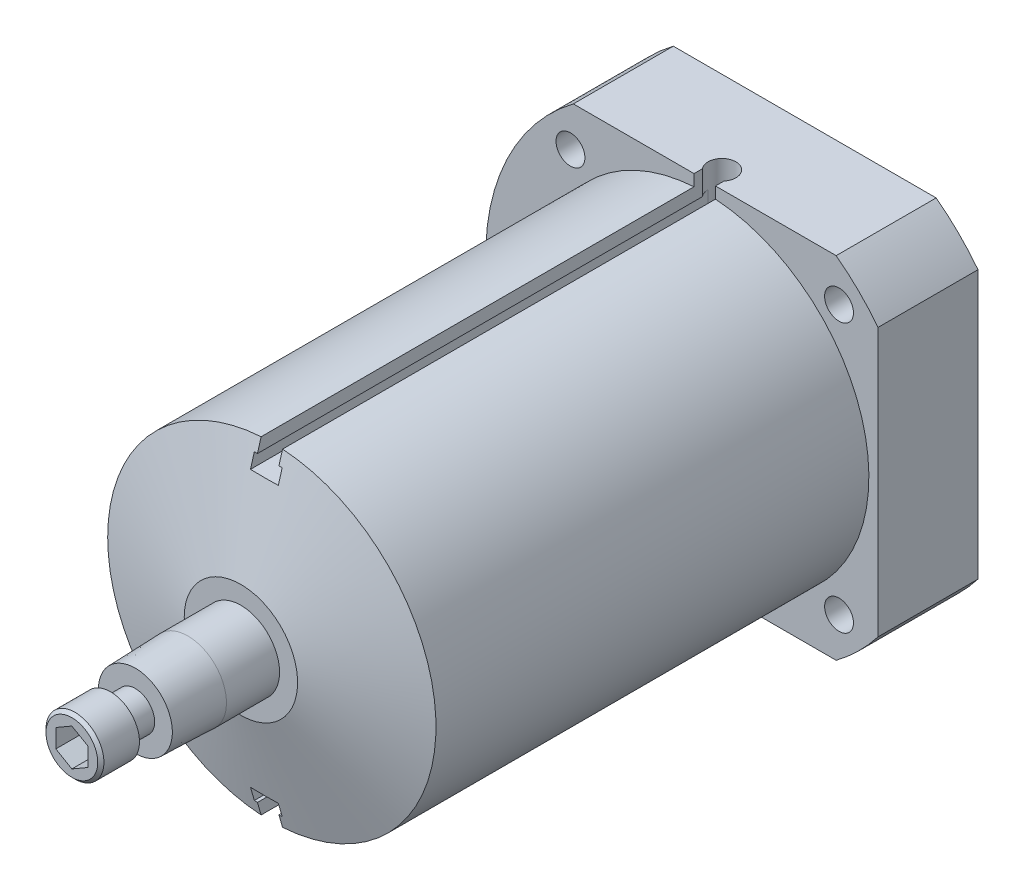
ISO-10303-21;
HEADER;
FILE_DESCRIPTION(('STEP AP214'),'2;1');
FILE_NAME('part.step','',(''),(''),'','','');
FILE_SCHEMA(('AUTOMOTIVE_DESIGN { 1 0 10303 214 1 1 1 1 }'));
ENDSEC;
DATA;
#1=APPLICATION_CONTEXT('core data for automotive mechanical design processes');
#2=APPLICATION_PROTOCOL_DEFINITION('international standard','automotive_design',2000,#1);
#3=PRODUCT_CONTEXT('',#1,'mechanical');
#4=PRODUCT('Part','Part','',(#3));
#5=PRODUCT_RELATED_PRODUCT_CATEGORY('part','',(#4));
#6=PRODUCT_DEFINITION_FORMATION('','',#4);
#7=PRODUCT_DEFINITION_CONTEXT('part definition',#1,'design');
#8=PRODUCT_DEFINITION('design','',#6,#7);
#9=PRODUCT_DEFINITION_SHAPE('','',#8);
#10=(LENGTH_UNIT() NAMED_UNIT(*) SI_UNIT(.MILLI.,.METRE.));
#11=(NAMED_UNIT(*) PLANE_ANGLE_UNIT() SI_UNIT($,.RADIAN.));
#12=(NAMED_UNIT(*) SI_UNIT($,.STERADIAN.) SOLID_ANGLE_UNIT());
#13=UNCERTAINTY_MEASURE_WITH_UNIT(LENGTH_MEASURE(1.E-05),#10,'distance_accuracy_value','');
#14=(GEOMETRIC_REPRESENTATION_CONTEXT(3) GLOBAL_UNCERTAINTY_ASSIGNED_CONTEXT((#13)) GLOBAL_UNIT_ASSIGNED_CONTEXT((#10,
#11,#12)) REPRESENTATION_CONTEXT('',''));
#15=CARTESIAN_POINT('',(0.,0.,0.));
#16=DIRECTION('',(0.,0.,1.));
#17=DIRECTION('',(1.,0.,0.));
#18=AXIS2_PLACEMENT_3D('',#15,#16,#17);
#19=CARTESIAN_POINT('',(0.,0.,138.938));
#20=DIRECTION('',(0.,0.,-1.));
#21=DIRECTION('',(-1.,0.,0.));
#22=AXIS2_PLACEMENT_3D('',#19,#20,#21);
#23=CYLINDRICAL_SURFACE('',#22,53.975);
#24=CARTESIAN_POINT('',(-47.0116038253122,26.5181019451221,15.7988));
#25=CARTESIAN_POINT('',(-47.0116100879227,26.5180935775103,15.5651905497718));
#26=CARTESIAN_POINT('',(-47.0213302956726,26.5008815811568,15.3314205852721));
#27=CARTESIAN_POINT('',(-47.0598493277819,26.4324173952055,14.8703444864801));
#28=CARTESIAN_POINT('',(-47.0886699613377,26.3811262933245,14.6430460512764));
#29=CARTESIAN_POINT('',(-47.1642112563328,26.2458333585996,14.2016579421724));
#30=CARTESIAN_POINT('',(-47.2109219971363,26.1618496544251,13.9875610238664));
#31=CARTESIAN_POINT('',(-47.3203783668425,25.9633434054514,13.5785483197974));
#32=CARTESIAN_POINT('',(-47.38312048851,25.8488275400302,13.3836283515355));
#33=CARTESIAN_POINT('',(-47.5223635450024,25.5919306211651,13.0180171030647));
#34=CARTESIAN_POINT('',(-47.5988913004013,25.449495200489,12.8473742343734));
#35=CARTESIAN_POINT('',(-47.7627684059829,25.1405864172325,12.5355765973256));
#36=CARTESIAN_POINT('',(-47.8501182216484,24.9741120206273,12.3944230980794));
#37=CARTESIAN_POINT('',(-48.0326184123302,24.621284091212,12.14545306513));
#38=CARTESIAN_POINT('',(-48.1277782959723,24.434906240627,12.0376779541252));
#39=CARTESIAN_POINT('',(-48.3225363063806,24.0474546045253,11.858789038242));
#40=CARTESIAN_POINT('',(-48.4221343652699,23.8463810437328,11.7876746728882));
#41=CARTESIAN_POINT('',(-48.6223270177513,23.4354866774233,11.6842640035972));
#42=CARTESIAN_POINT('',(-48.7229192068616,23.2256842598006,11.651889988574));
#43=CARTESIAN_POINT('',(-48.9222396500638,22.8028444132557,11.6266388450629));
#44=CARTESIAN_POINT('',(-49.0209679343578,22.5898070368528,11.6337610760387));
#45=CARTESIAN_POINT('',(-49.2135820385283,22.1670437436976,11.6872365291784));
#46=CARTESIAN_POINT('',(-49.3074777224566,21.957311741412,11.7335061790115));
#47=CARTESIAN_POINT('',(-49.4882627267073,21.5467589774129,11.8638331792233));
#48=CARTESIAN_POINT('',(-49.5751519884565,21.3459382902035,11.947890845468));
#49=CARTESIAN_POINT('',(-49.7400273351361,20.9588800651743,12.1515014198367));
#50=CARTESIAN_POINT('',(-49.8180038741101,20.7726582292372,12.2710919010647));
#51=CARTESIAN_POINT('',(-49.9633677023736,20.420549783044,12.5423460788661));
#52=CARTESIAN_POINT('',(-50.0307548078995,20.2546635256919,12.6940103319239));
#53=CARTESIAN_POINT('',(-50.153896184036,19.9478016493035,13.0255782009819));
#54=CARTESIAN_POINT('',(-50.2096196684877,19.8068921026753,13.2055544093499));
#55=CARTESIAN_POINT('',(-50.3083271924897,19.5548260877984,13.5883839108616));
#56=CARTESIAN_POINT('',(-50.3513112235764,19.4436696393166,13.7912372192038));
#57=CARTESIAN_POINT('',(-50.4239332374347,19.2545551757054,14.2141122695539));
#58=CARTESIAN_POINT('',(-50.4535698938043,19.1766004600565,14.4341357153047));
#59=CARTESIAN_POINT('',(-50.4991045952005,19.0563697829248,14.8850820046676));
#60=CARTESIAN_POINT('',(-50.5150028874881,19.0140931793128,15.1160046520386));
#61=CARTESIAN_POINT('',(-50.5328433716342,18.9666291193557,15.5815571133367));
#62=CARTESIAN_POINT('',(-50.5348214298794,18.9613463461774,15.8161758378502));
#63=CARTESIAN_POINT('',(-50.5248928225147,18.9877861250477,16.2830203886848));
#64=CARTESIAN_POINT('',(-50.5129862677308,19.0195083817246,16.5152462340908));
#65=CARTESIAN_POINT('',(-50.475455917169,19.1188849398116,16.9704228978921));
#66=CARTESIAN_POINT('',(-50.4498489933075,19.1864950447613,17.1933847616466));
#67=CARTESIAN_POINT('',(-50.3852525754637,19.3554923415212,17.6240461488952));
#68=CARTESIAN_POINT('',(-50.346262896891,19.4568799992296,17.8317454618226));
#69=CARTESIAN_POINT('',(-50.2553420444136,19.6905283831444,18.2264511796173));
#70=CARTESIAN_POINT('',(-50.2033846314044,19.822851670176,18.4134145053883));
#71=CARTESIAN_POINT('',(-50.0873616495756,20.1142076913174,18.760906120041));
#72=CARTESIAN_POINT('',(-50.0232959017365,20.2732408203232,18.9214340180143));
#73=CARTESIAN_POINT('',(-49.8840117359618,20.6135832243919,19.2118434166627));
#74=CARTESIAN_POINT('',(-49.8087698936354,20.7949391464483,19.3416590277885));
#75=CARTESIAN_POINT('',(-49.6487141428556,21.1742325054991,19.5665071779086));
#76=CARTESIAN_POINT('',(-49.5639003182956,21.3721697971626,19.6615400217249));
#77=CARTESIAN_POINT('',(-49.386684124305,21.7785467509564,19.8140113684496));
#78=CARTESIAN_POINT('',(-49.2942901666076,21.9869746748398,19.8714909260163));
#79=CARTESIAN_POINT('',(-49.1041314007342,22.4084432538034,19.9473583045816));
#80=CARTESIAN_POINT('',(-49.0063666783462,22.6214838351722,19.9657467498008));
#81=CARTESIAN_POINT('',(-48.8084072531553,23.045490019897,19.9629030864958));
#82=CARTESIAN_POINT('',(-48.7082195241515,23.256459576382,19.9417737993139));
#83=CARTESIAN_POINT('',(-48.508140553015,23.6709506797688,19.8607084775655));
#84=CARTESIAN_POINT('',(-48.4082493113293,23.8744722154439,19.800772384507));
#85=CARTESIAN_POINT('',(-48.2119385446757,24.2684587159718,19.6438200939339));
#86=CARTESIAN_POINT('',(-48.1155188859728,24.4589241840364,19.5468053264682));
#87=CARTESIAN_POINT('',(-47.929386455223,24.8216871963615,19.3184618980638));
#88=CARTESIAN_POINT('',(-47.8396735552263,24.9939850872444,19.1871338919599));
#89=CARTESIAN_POINT('',(-47.6699013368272,25.3162882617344,18.893506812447));
#90=CARTESIAN_POINT('',(-47.589866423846,25.4662373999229,18.7311320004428));
#91=CARTESIAN_POINT('',(-47.4426449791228,25.7394681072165,18.3801499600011));
#92=CARTESIAN_POINT('',(-47.3754615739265,25.8627431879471,18.1915363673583));
#93=CARTESIAN_POINT('',(-47.2564435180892,26.0795809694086,17.7931144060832));
#94=CARTESIAN_POINT('',(-47.2046345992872,26.1730938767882,17.5832712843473));
#95=CARTESIAN_POINT('',(-47.1186190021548,26.3276330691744,17.1487459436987));
#96=CARTESIAN_POINT('',(-47.084391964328,26.3886969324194,16.9240812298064));
#97=CARTESIAN_POINT('',(-47.0436994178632,26.4611405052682,16.5481955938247));
#98=CARTESIAN_POINT('',(-47.0316849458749,26.4824754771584,16.3993963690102));
#99=CARTESIAN_POINT('',(-47.015635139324,26.5109588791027,16.1000203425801));
#100=CARTESIAN_POINT('',(-47.0115997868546,26.5181073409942,15.9494435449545));
#101=CARTESIAN_POINT('',(-47.0116038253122,26.5181019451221,15.7988));
#102=B_SPLINE_CURVE_WITH_KNOTS('',3,(#24,#25,#26,#27,#28,#29,#30,#31,#32,#33,#34,#35,#36,#37,
#38,#39,#40,#41,#42,#43,#44,#45,#46,#47,#48,#49,#50,#51,#52,#53,#54,#55,#56,#57,#58,#59,#60,#61,
#62,#63,#64,#65,#66,#67,#68,#69,#70,#71,#72,#73,#74,#75,#76,#77,#78,#79,#80,#81,#82,#83,#84,#85,
#86,#87,#88,#89,#90,#91,#92,#93,#94,#95,#96,#97,#98,#99,#100,#101),.UNSPECIFIED.,.T.,.F.,(4,2,2,
2,2,2,2,2,2,2,2,2,2,2,2,2,2,2,2,2,2,2,2,2,2,2,2,2,2,2,2,2,2,2,2,2,2,2,4),(0.,0.700278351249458,
1.40135767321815,2.10204878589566,2.80258673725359,3.50450263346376,4.20644873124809,
4.9092624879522,5.61206549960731,6.3134563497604,7.01483582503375,7.7147217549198,
8.41461353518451,9.1152480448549,9.81589471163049,10.5183680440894,11.2208418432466,
11.9233854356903,12.6259163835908,13.3266365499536,14.027351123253,14.7272047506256,
15.427068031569,16.1283590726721,16.8296604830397,17.5324530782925,18.2352395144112,
18.9372563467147,19.6392619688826,20.3394435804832,21.0396262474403,21.739781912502,
22.43992421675,23.1417968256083,23.8438399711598,24.5470515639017,25.2494470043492,
25.701023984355,26.1525999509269),.UNSPECIFIED.);
#103=CARTESIAN_POINT('',(-47.0116038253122,26.5181019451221,15.7988));
#104=VERTEX_POINT('',#103);
#105=EDGE_CURVE('E517',#104,#104,#102,.T.);
#106=ORIENTED_EDGE('',*,*,#105,.F.);
#107=EDGE_LOOP('',(#106));
#108=FACE_BOUND('',#107,.T.);
#109=DIRECTION('',(0.,0.,-1.));
#110=VECTOR('',#109,1.);
#111=CARTESIAN_POINT('',(-32.385,-43.18,138.938));
#112=LINE('',#111,#110);
#113=CARTESIAN_POINT('',(-32.385,-43.18,24.638));
#114=VERTEX_POINT('',#113);
#115=CARTESIAN_POINT('',(-32.385,-43.18,0.));
#116=VERTEX_POINT('',#115);
#117=EDGE_CURVE('E584',#114,#116,#112,.T.);
#118=ORIENTED_EDGE('',*,*,#117,.F.);
#119=CARTESIAN_POINT('',(0.,0.,24.638));
#120=DIRECTION('',(0.,0.,-1.));
#121=DIRECTION('',(-1.,0.,0.));
#122=AXIS2_PLACEMENT_3D('',#119,#120,#121);
#123=CIRCLE('',#122,53.975);
#124=CARTESIAN_POINT('',(-32.385,43.18,24.638));
#125=VERTEX_POINT('',#124);
#126=EDGE_CURVE('E587',#114,#125,#123,.T.);
#127=ORIENTED_EDGE('',*,*,#126,.T.);
#128=DIRECTION('',(0.,0.,-1.));
#129=VECTOR('',#128,1.);
#130=CARTESIAN_POINT('',(-32.385,43.18,138.938));
#131=LINE('',#130,#129);
#132=CARTESIAN_POINT('',(-32.385,43.18,0.));
#133=VERTEX_POINT('',#132);
#134=EDGE_CURVE('E753',#125,#133,#131,.T.);
#135=ORIENTED_EDGE('',*,*,#134,.T.);
#136=CARTESIAN_POINT('',(0.,0.,0.));
#137=DIRECTION('',(0.,0.,1.));
#138=DIRECTION('',(1.,0.,0.));
#139=AXIS2_PLACEMENT_3D('',#136,#137,#138);
#140=CIRCLE('',#139,53.975);
#141=EDGE_CURVE('E590',#133,#116,#140,.T.);
#142=ORIENTED_EDGE('',*,*,#141,.T.);
#143=EDGE_LOOP('',(#118,#127,#135,#142));
#144=FACE_BOUND('',#143,.T.);
#145=CARTESIAN_POINT('',(-47.0116038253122,-26.5181019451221,15.7988));
#146=CARTESIAN_POINT('',(-47.0116100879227,-26.5180935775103,16.0324094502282));
#147=CARTESIAN_POINT('',(-47.0213302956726,-26.5008815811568,16.2661794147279));
#148=CARTESIAN_POINT('',(-47.0598493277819,-26.4324173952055,16.7272555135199));
#149=CARTESIAN_POINT('',(-47.0886699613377,-26.3811262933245,16.9545539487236));
#150=CARTESIAN_POINT('',(-47.1642112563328,-26.2458333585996,17.3959420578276));
#151=CARTESIAN_POINT('',(-47.2109219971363,-26.1618496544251,17.6100389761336));
#152=CARTESIAN_POINT('',(-47.3203783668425,-25.9633434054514,18.0190516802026));
#153=CARTESIAN_POINT('',(-47.38312048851,-25.8488275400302,18.2139716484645));
#154=CARTESIAN_POINT('',(-47.5223635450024,-25.5919306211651,18.5795828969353));
#155=CARTESIAN_POINT('',(-47.5988913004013,-25.449495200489,18.7502257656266));
#156=CARTESIAN_POINT('',(-47.7627684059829,-25.1405864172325,19.0620234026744));
#157=CARTESIAN_POINT('',(-47.8501182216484,-24.9741120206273,19.2031769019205));
#158=CARTESIAN_POINT('',(-48.0326184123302,-24.621284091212,19.45214693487));
#159=CARTESIAN_POINT('',(-48.1277782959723,-24.434906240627,19.5599220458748));
#160=CARTESIAN_POINT('',(-48.3225363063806,-24.0474546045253,19.738810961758));
#161=CARTESIAN_POINT('',(-48.4221343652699,-23.8463810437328,19.8099253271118));
#162=CARTESIAN_POINT('',(-48.6223270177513,-23.4354866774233,19.9133359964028));
#163=CARTESIAN_POINT('',(-48.7229192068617,-23.2256842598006,19.945710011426));
#164=CARTESIAN_POINT('',(-48.9222396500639,-22.8028444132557,19.9709611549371));
#165=CARTESIAN_POINT('',(-49.0209679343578,-22.5898070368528,19.9638389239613));
#166=CARTESIAN_POINT('',(-49.2135820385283,-22.1670437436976,19.9103634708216));
#167=CARTESIAN_POINT('',(-49.3074777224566,-21.957311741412,19.8640938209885));
#168=CARTESIAN_POINT('',(-49.4882627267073,-21.5467589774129,19.7337668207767));
#169=CARTESIAN_POINT('',(-49.5751519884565,-21.3459382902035,19.649709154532));
#170=CARTESIAN_POINT('',(-49.7400273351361,-20.9588800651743,19.4460985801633));
#171=CARTESIAN_POINT('',(-49.8180038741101,-20.7726582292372,19.3265080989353));
#172=CARTESIAN_POINT('',(-49.9633677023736,-20.420549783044,19.0552539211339));
#173=CARTESIAN_POINT('',(-50.0307548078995,-20.2546635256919,18.9035896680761));
#174=CARTESIAN_POINT('',(-50.153896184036,-19.9478016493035,18.5720217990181));
#175=CARTESIAN_POINT('',(-50.2096196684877,-19.8068921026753,18.3920455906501));
#176=CARTESIAN_POINT('',(-50.3083271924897,-19.5548260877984,18.0092160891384));
#177=CARTESIAN_POINT('',(-50.3513112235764,-19.4436696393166,17.8063627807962));
#178=CARTESIAN_POINT('',(-50.4239332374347,-19.2545551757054,17.3834877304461));
#179=CARTESIAN_POINT('',(-50.4535698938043,-19.1766004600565,17.1634642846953));
#180=CARTESIAN_POINT('',(-50.4991045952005,-19.0563697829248,16.7125179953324));
#181=CARTESIAN_POINT('',(-50.5150028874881,-19.0140931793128,16.4815953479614));
#182=CARTESIAN_POINT('',(-50.5328433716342,-18.9666291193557,16.0160428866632));
#183=CARTESIAN_POINT('',(-50.5348214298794,-18.9613463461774,15.7814241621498));
#184=CARTESIAN_POINT('',(-50.5248928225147,-18.9877861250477,15.3145796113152));
#185=CARTESIAN_POINT('',(-50.5129862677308,-19.0195083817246,15.0823537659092));
#186=CARTESIAN_POINT('',(-50.475455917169,-19.1188849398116,14.6271771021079));
#187=CARTESIAN_POINT('',(-50.4498489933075,-19.1864950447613,14.4042152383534));
#188=CARTESIAN_POINT('',(-50.3852525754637,-19.3554923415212,13.9735538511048));
#189=CARTESIAN_POINT('',(-50.346262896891,-19.4568799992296,13.7658545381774));
#190=CARTESIAN_POINT('',(-50.2553420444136,-19.6905283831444,13.3711488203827));
#191=CARTESIAN_POINT('',(-50.2033846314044,-19.822851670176,13.1841854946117));
#192=CARTESIAN_POINT('',(-50.0873616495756,-20.1142076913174,12.836693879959));
#193=CARTESIAN_POINT('',(-50.0232959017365,-20.2732408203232,12.6761659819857));
#194=CARTESIAN_POINT('',(-49.8840117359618,-20.6135832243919,12.3857565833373));
#195=CARTESIAN_POINT('',(-49.8087698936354,-20.7949391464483,12.2559409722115));
#196=CARTESIAN_POINT('',(-49.6487141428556,-21.1742325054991,12.0310928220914));
#197=CARTESIAN_POINT('',(-49.5639003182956,-21.3721697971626,11.9360599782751));
#198=CARTESIAN_POINT('',(-49.386684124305,-21.7785467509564,11.7835886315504));
#199=CARTESIAN_POINT('',(-49.2942901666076,-21.9869746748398,11.7261090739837));
#200=CARTESIAN_POINT('',(-49.1041314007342,-22.4084432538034,11.6502416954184));
#201=CARTESIAN_POINT('',(-49.0063666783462,-22.6214838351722,11.6318532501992));
#202=CARTESIAN_POINT('',(-48.8084072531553,-23.045490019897,11.6346969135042));
#203=CARTESIAN_POINT('',(-48.7082195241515,-23.256459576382,11.6558262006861));
#204=CARTESIAN_POINT('',(-48.508140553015,-23.6709506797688,11.7368915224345));
#205=CARTESIAN_POINT('',(-48.4082493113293,-23.874472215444,11.796827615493));
#206=CARTESIAN_POINT('',(-48.2119385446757,-24.2684587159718,11.9537799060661));
#207=CARTESIAN_POINT('',(-48.1155188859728,-24.4589241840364,12.0507946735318));
#208=CARTESIAN_POINT('',(-47.929386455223,-24.8216871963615,12.2791381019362));
#209=CARTESIAN_POINT('',(-47.8396735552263,-24.9939850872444,12.4104661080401));
#210=CARTESIAN_POINT('',(-47.6699013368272,-25.3162882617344,12.704093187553));
#211=CARTESIAN_POINT('',(-47.589866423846,-25.4662373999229,12.8664679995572));
#212=CARTESIAN_POINT('',(-47.4426449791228,-25.7394681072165,13.2174500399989));
#213=CARTESIAN_POINT('',(-47.3754615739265,-25.8627431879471,13.4060636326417));
#214=CARTESIAN_POINT('',(-47.2564435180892,-26.0795809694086,13.8044855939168));
#215=CARTESIAN_POINT('',(-47.2046345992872,-26.1730938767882,14.0143287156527));
#216=CARTESIAN_POINT('',(-47.1186190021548,-26.3276330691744,14.4488540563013));
#217=CARTESIAN_POINT('',(-47.084391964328,-26.3886969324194,14.6735187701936));
#218=CARTESIAN_POINT('',(-47.0436994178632,-26.4611405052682,15.0494044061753));
#219=CARTESIAN_POINT('',(-47.0316849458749,-26.4824754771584,15.1982036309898));
#220=CARTESIAN_POINT('',(-47.015635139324,-26.5109588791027,15.4975796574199));
#221=CARTESIAN_POINT('',(-47.0115997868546,-26.5181073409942,15.6481564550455));
#222=CARTESIAN_POINT('',(-47.0116038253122,-26.5181019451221,15.7988));
#223=B_SPLINE_CURVE_WITH_KNOTS('',3,(#145,#146,#147,#148,#149,#150,#151,#152,#153,#154,#155,
#156,#157,#158,#159,#160,#161,#162,#163,#164,#165,#166,#167,#168,#169,#170,#171,#172,#173,#174,
#175,#176,#177,#178,#179,#180,#181,#182,#183,#184,#185,#186,#187,#188,#189,#190,#191,#192,#193,
#194,#195,#196,#197,#198,#199,#200,#201,#202,#203,#204,#205,#206,#207,#208,#209,#210,#211,#212,
#213,#214,#215,#216,#217,#218,#219,#220,#221,#222),.UNSPECIFIED.,.T.,.F.,(4,2,2,2,2,2,2,2,2,2,2,
2,2,2,2,2,2,2,2,2,2,2,2,2,2,2,2,2,2,2,2,2,2,2,2,2,2,2,4),(0.,0.70027835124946,1.40135767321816,
2.10204878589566,2.80258673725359,3.50450263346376,4.20644873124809,4.9092624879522,
5.61206549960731,6.31345634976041,7.01483582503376,7.7147217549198,8.41461353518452,
9.1152480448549,9.81589471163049,10.5183680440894,11.2208418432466,11.9233854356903,
12.6259163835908,13.3266365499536,14.027351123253,14.7272047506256,15.427068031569,
16.1283590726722,16.8296604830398,17.5324530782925,18.2352395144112,18.9372563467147,
19.6392619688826,20.3394435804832,21.0396262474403,21.739781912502,22.43992421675,
23.1417968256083,23.8438399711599,24.5470515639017,25.2494470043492,25.701023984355,
26.152599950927),.UNSPECIFIED.);
#224=CARTESIAN_POINT('',(-47.0116038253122,-26.5181019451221,15.7988));
#225=VERTEX_POINT('',#224);
#226=EDGE_CURVE('E510',#225,#225,#223,.T.);
#227=ORIENTED_EDGE('',*,*,#226,.F.);
#228=EDGE_LOOP('',(#227));
#229=FACE_BOUND('',#228,.T.);
#230=ADVANCED_FACE('F36',(#108,#144,#229),#23,.T.);
#231=CARTESIAN_POINT('',(-53.975,0.,24.638));
#232=DIRECTION('',(0.,0.,-1.));
#233=DIRECTION('',(-1.,0.,0.));
#234=AXIS2_PLACEMENT_3D('',#231,#232,#233);
#235=PLANE('',#234);
#236=CARTESIAN_POINT('',(-33.09224380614,-33.0922438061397,24.638));
#237=DIRECTION('',(0.,0.,1.));
#238=DIRECTION('',(1.,0.,0.));
#239=AXIS2_PLACEMENT_3D('',#236,#237,#238);
#240=CIRCLE('',#239,3.55600000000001);
#241=CARTESIAN_POINT('',(-29.53624380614,-33.0922438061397,24.638));
#242=VERTEX_POINT('',#241);
#243=EDGE_CURVE('E694',#242,#242,#240,.T.);
#244=ORIENTED_EDGE('',*,*,#243,.F.);
#245=EDGE_LOOP('',(#244));
#246=FACE_BOUND('',#245,.T.);
#247=CARTESIAN_POINT('',(33.0922438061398,33.0922438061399,24.638));
#248=DIRECTION('',(0.,0.,1.));
#249=DIRECTION('',(1.,0.,0.));
#250=AXIS2_PLACEMENT_3D('',#247,#248,#249);
#251=CIRCLE('',#250,3.55600000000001);
#252=CARTESIAN_POINT('',(36.6482438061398,33.0922438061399,24.638));
#253=VERTEX_POINT('',#252);
#254=EDGE_CURVE('E706',#253,#253,#251,.T.);
#255=ORIENTED_EDGE('',*,*,#254,.F.);
#256=EDGE_LOOP('',(#255));
#257=FACE_BOUND('',#256,.T.);
#258=DIRECTION('',(1.,0.,0.));
#259=VECTOR('',#258,1.);
#260=CARTESIAN_POINT('',(-32.385,43.18,24.638));
#261=LINE('',#260,#259);
#262=CARTESIAN_POINT('',(2.6416,43.18,24.638));
#263=VERTEX_POINT('',#262);
#264=CARTESIAN_POINT('',(32.385,43.18,24.638));
#265=VERTEX_POINT('',#264);
#266=EDGE_CURVE('E595',#263,#265,#261,.T.);
#267=ORIENTED_EDGE('',*,*,#266,.F.);
#268=DIRECTION('',(0.,-1.,0.));
#269=VECTOR('',#268,1.);
#270=CARTESIAN_POINT('',(2.64159999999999,0.,24.638));
#271=LINE('',#270,#269);
#272=CARTESIAN_POINT('',(2.6416,40.3631515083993,24.638));
#273=VERTEX_POINT('',#272);
#274=EDGE_CURVE('E680',#263,#273,#271,.T.);
#275=ORIENTED_EDGE('',*,*,#274,.T.);
#276=CARTESIAN_POINT('',(0.,0.,24.638));
#277=DIRECTION('',(0.,0.,-1.));
#278=DIRECTION('',(-1.,0.,0.));
#279=AXIS2_PLACEMENT_3D('',#276,#277,#278);
#280=CIRCLE('',#279,40.4495);
#281=CARTESIAN_POINT('',(-2.6416,40.3631515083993,24.638));
#282=VERTEX_POINT('',#281);
#283=EDGE_CURVE('E727',#273,#282,#280,.T.);
#284=ORIENTED_EDGE('',*,*,#283,.T.);
#285=DIRECTION('',(0.,1.,0.));
#286=VECTOR('',#285,1.);
#287=CARTESIAN_POINT('',(-2.64159999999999,0.,24.638));
#288=LINE('',#287,#286);
#289=CARTESIAN_POINT('',(-2.6416,43.18,24.638));
#290=VERTEX_POINT('',#289);
#291=EDGE_CURVE('E672',#282,#290,#288,.T.);
#292=ORIENTED_EDGE('',*,*,#291,.T.);
#293=EDGE_CURVE('E598',#125,#290,#261,.T.);
#294=ORIENTED_EDGE('',*,*,#293,.F.);
#295=ORIENTED_EDGE('',*,*,#126,.F.);
#296=DIRECTION('',(-1.,0.,0.));
#297=VECTOR('',#296,1.);
#298=CARTESIAN_POINT('',(-32.385,-43.18,24.638));
#299=LINE('',#298,#297);
#300=CARTESIAN_POINT('',(32.385,-43.18,24.638));
#301=VERTEX_POINT('',#300);
#302=EDGE_CURVE('E736',#301,#114,#299,.T.);
#303=ORIENTED_EDGE('',*,*,#302,.F.);
#304=CARTESIAN_POINT('',(42.6974,-33.0186713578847,24.638));
#305=VERTEX_POINT('',#304);
#306=EDGE_CURVE('E731',#305,#301,#123,.T.);
#307=ORIENTED_EDGE('',*,*,#306,.F.);
#308=DIRECTION('',(0.,-1.,0.));
#309=VECTOR('',#308,1.);
#310=CARTESIAN_POINT('',(42.6974,33.0186713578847,24.638));
#311=LINE('',#310,#309);
#312=CARTESIAN_POINT('',(42.6974,33.0186713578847,24.638));
#313=VERTEX_POINT('',#312);
#314=EDGE_CURVE('E733',#313,#305,#311,.T.);
#315=ORIENTED_EDGE('',*,*,#314,.F.);
#316=EDGE_CURVE('E732',#265,#313,#123,.T.);
#317=ORIENTED_EDGE('',*,*,#316,.F.);
#318=EDGE_LOOP('',(#267,#275,#284,#292,#294,#295,#303,#307,#315,#317));
#319=FACE_BOUND('',#318,.T.);
#320=CARTESIAN_POINT('',(33.0922438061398,-33.0922438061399,24.638));
#321=DIRECTION('',(0.,0.,1.));
#322=DIRECTION('',(1.,0.,0.));
#323=AXIS2_PLACEMENT_3D('',#320,#321,#322);
#324=CIRCLE('',#323,3.55600000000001);
#325=CARTESIAN_POINT('',(36.6482438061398,-33.0922438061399,24.638));
#326=VERTEX_POINT('',#325);
#327=EDGE_CURVE('E700',#326,#326,#324,.T.);
#328=ORIENTED_EDGE('',*,*,#327,.F.);
#329=EDGE_LOOP('',(#328));
#330=FACE_BOUND('',#329,.T.);
#331=CARTESIAN_POINT('',(-33.0922438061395,33.0922438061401,24.638));
#332=DIRECTION('',(0.,0.,1.));
#333=DIRECTION('',(1.,0.,0.));
#334=AXIS2_PLACEMENT_3D('',#331,#332,#333);
#335=CIRCLE('',#334,3.55600000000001);
#336=CARTESIAN_POINT('',(-29.5362438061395,33.0922438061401,24.638));
#337=VERTEX_POINT('',#336);
#338=EDGE_CURVE('E522',#337,#337,#335,.T.);
#339=ORIENTED_EDGE('',*,*,#338,.F.);
#340=EDGE_LOOP('',(#339));
#341=FACE_BOUND('',#340,.T.);
#342=ADVANCED_FACE('F571',(#246,#257,#319,#330,#341),#235,.F.);
#343=CARTESIAN_POINT('',(-32.385,-43.18,138.938));
#344=DIRECTION('',(0.,1.,0.));
#345=DIRECTION('',(0.,0.,1.));
#346=AXIS2_PLACEMENT_3D('',#343,#344,#345);
#347=PLANE('',#346);
#348=DIRECTION('',(0.,0.,-1.));
#349=VECTOR('',#348,1.);
#350=CARTESIAN_POINT('',(32.385,-43.18,138.938));
#351=LINE('',#350,#349);
#352=CARTESIAN_POINT('',(32.385,-43.18,0.));
#353=VERTEX_POINT('',#352);
#354=EDGE_CURVE('E596',#301,#353,#351,.T.);
#355=ORIENTED_EDGE('',*,*,#354,.F.);
#356=ORIENTED_EDGE('',*,*,#302,.T.);
#357=ORIENTED_EDGE('',*,*,#117,.T.);
#358=DIRECTION('',(1.,0.,0.));
#359=VECTOR('',#358,1.);
#360=CARTESIAN_POINT('',(-32.385,-43.18,0.));
#361=LINE('',#360,#359);
#362=EDGE_CURVE('E739',#116,#353,#361,.T.);
#363=ORIENTED_EDGE('',*,*,#362,.T.);
#364=EDGE_LOOP('',(#355,#356,#357,#363));
#365=FACE_BOUND('',#364,.T.);
#366=ADVANCED_FACE('F576',(#365),#347,.F.);
#367=CARTESIAN_POINT('',(0.,0.,138.938));
#368=DIRECTION('',(0.,0.,-1.));
#369=DIRECTION('',(-1.,0.,0.));
#370=AXIS2_PLACEMENT_3D('',#367,#368,#369);
#371=CYLINDRICAL_SURFACE('',#370,53.975);
#372=DIRECTION('',(0.,0.,-1.));
#373=VECTOR('',#372,1.);
#374=CARTESIAN_POINT('',(42.6974,-33.0186713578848,138.938));
#375=LINE('',#374,#373);
#376=CARTESIAN_POINT('',(42.6974,-33.0186713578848,0.));
#377=VERTEX_POINT('',#376);
#378=EDGE_CURVE('E599',#305,#377,#375,.T.);
#379=ORIENTED_EDGE('',*,*,#378,.F.);
#380=ORIENTED_EDGE('',*,*,#306,.T.);
#381=ORIENTED_EDGE('',*,*,#354,.T.);
#382=CARTESIAN_POINT('',(0.,0.,0.));
#383=DIRECTION('',(0.,0.,1.));
#384=DIRECTION('',(1.,0.,0.));
#385=AXIS2_PLACEMENT_3D('',#382,#383,#384);
#386=CIRCLE('',#385,53.975);
#387=EDGE_CURVE('E741',#353,#377,#386,.T.);
#388=ORIENTED_EDGE('',*,*,#387,.T.);
#389=EDGE_LOOP('',(#379,#380,#381,#388));
#390=FACE_BOUND('',#389,.T.);
#391=ADVANCED_FACE('F767',(#390),#371,.T.);
#392=CARTESIAN_POINT('',(42.6974,33.0186713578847,138.938));
#393=DIRECTION('',(-1.,0.,0.));
#394=DIRECTION('',(0.,0.,1.));
#395=AXIS2_PLACEMENT_3D('',#392,#393,#394);
#396=PLANE('',#395);
#397=DIRECTION('',(0.,0.,-1.));
#398=VECTOR('',#397,1.);
#399=CARTESIAN_POINT('',(42.6974,33.0186713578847,138.938));
#400=LINE('',#399,#398);
#401=CARTESIAN_POINT('',(42.6974,33.0186713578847,0.));
#402=VERTEX_POINT('',#401);
#403=EDGE_CURVE('E757',#313,#402,#400,.T.);
#404=ORIENTED_EDGE('',*,*,#403,.F.);
#405=ORIENTED_EDGE('',*,*,#314,.T.);
#406=ORIENTED_EDGE('',*,*,#378,.T.);
#407=DIRECTION('',(0.,1.,0.));
#408=VECTOR('',#407,1.);
#409=CARTESIAN_POINT('',(42.6974,33.0186713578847,0.));
#410=LINE('',#409,#408);
#411=EDGE_CURVE('E744',#377,#402,#410,.T.);
#412=ORIENTED_EDGE('',*,*,#411,.T.);
#413=EDGE_LOOP('',(#404,#405,#406,#412));
#414=FACE_BOUND('',#413,.T.);
#415=ADVANCED_FACE('F761',(#414),#396,.F.);
#416=CARTESIAN_POINT('',(0.,0.,138.938));
#417=DIRECTION('',(0.,0.,-1.));
#418=DIRECTION('',(-1.,0.,0.));
#419=AXIS2_PLACEMENT_3D('',#416,#417,#418);
#420=CYLINDRICAL_SURFACE('',#419,53.975);
#421=DIRECTION('',(0.,0.,-1.));
#422=VECTOR('',#421,1.);
#423=CARTESIAN_POINT('',(32.385,43.18,138.938));
#424=LINE('',#423,#422);
#425=CARTESIAN_POINT('',(32.385,43.18,0.));
#426=VERTEX_POINT('',#425);
#427=EDGE_CURVE('E755',#265,#426,#424,.T.);
#428=ORIENTED_EDGE('',*,*,#427,.F.);
#429=ORIENTED_EDGE('',*,*,#316,.T.);
#430=ORIENTED_EDGE('',*,*,#403,.T.);
#431=CARTESIAN_POINT('',(0.,0.,0.));
#432=DIRECTION('',(0.,0.,1.));
#433=DIRECTION('',(1.,0.,0.));
#434=AXIS2_PLACEMENT_3D('',#431,#432,#433);
#435=CIRCLE('',#434,53.975);
#436=EDGE_CURVE('E747',#402,#426,#435,.T.);
#437=ORIENTED_EDGE('',*,*,#436,.T.);
#438=EDGE_LOOP('',(#428,#429,#430,#437));
#439=FACE_BOUND('',#438,.T.);
#440=ADVANCED_FACE('F774',(#439),#420,.T.);
#441=CARTESIAN_POINT('',(-32.385,43.18,138.938));
#442=DIRECTION('',(0.,-1.,0.));
#443=DIRECTION('',(0.,0.,-1.));
#444=AXIS2_PLACEMENT_3D('',#441,#442,#443);
#445=PLANE('',#444);
#446=DIRECTION('',(0.,0.,-1.));
#447=VECTOR('',#446,1.);
#448=CARTESIAN_POINT('',(-2.6416,43.18,138.938));
#449=LINE('',#448,#447);
#450=CARTESIAN_POINT('',(-2.6416,43.18,22.5825189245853));
#451=VERTEX_POINT('',#450);
#452=EDGE_CURVE('E675',#290,#451,#449,.T.);
#453=ORIENTED_EDGE('',*,*,#452,.T.);
#454=CARTESIAN_POINT('',(0.,43.18,20.3962));
#455=DIRECTION('',(0.,1.,0.));
#456=DIRECTION('',(0.,0.,1.));
#457=AXIS2_PLACEMENT_3D('',#454,#455,#456);
#458=CIRCLE('',#457,3.429);
#459=CARTESIAN_POINT('',(2.6416,43.18,22.5825189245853));
#460=VERTEX_POINT('',#459);
#461=EDGE_CURVE('E60',#460,#451,#458,.T.);
#462=ORIENTED_EDGE('',*,*,#461,.F.);
#463=DIRECTION('',(0.,0.,1.));
#464=VECTOR('',#463,1.);
#465=CARTESIAN_POINT('',(2.6416,43.18,138.938));
#466=LINE('',#465,#464);
#467=EDGE_CURVE('E683',#460,#263,#466,.T.);
#468=ORIENTED_EDGE('',*,*,#467,.T.);
#469=ORIENTED_EDGE('',*,*,#266,.T.);
#470=ORIENTED_EDGE('',*,*,#427,.T.);
#471=DIRECTION('',(-1.,0.,0.));
#472=VECTOR('',#471,1.);
#473=CARTESIAN_POINT('',(-32.385,43.18,0.));
#474=LINE('',#473,#472);
#475=EDGE_CURVE('E750',#426,#133,#474,.T.);
#476=ORIENTED_EDGE('',*,*,#475,.T.);
#477=ORIENTED_EDGE('',*,*,#134,.F.);
#478=ORIENTED_EDGE('',*,*,#293,.T.);
#479=EDGE_LOOP('',(#453,#462,#468,#469,#470,#476,#477,#478));
#480=FACE_BOUND('',#479,.T.);
#481=ADVANCED_FACE('F824',(#480),#445,.F.);
#482=CARTESIAN_POINT('',(0.,0.,0.));
#483=DIRECTION('',(0.,0.,1.));
#484=DIRECTION('',(1.,0.,0.));
#485=AXIS2_PLACEMENT_3D('',#482,#483,#484);
#486=PLANE('',#485);
#487=CARTESIAN_POINT('',(-33.0922438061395,33.0922438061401,0.));
#488=DIRECTION('',(0.,0.,1.));
#489=DIRECTION('',(1.,0.,0.));
#490=AXIS2_PLACEMENT_3D('',#487,#488,#489);
#491=CIRCLE('',#490,3.55600000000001);
#492=CARTESIAN_POINT('',(-29.5362438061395,33.0922438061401,0.));
#493=VERTEX_POINT('',#492);
#494=EDGE_CURVE('E691',#493,#493,#491,.T.);
#495=ORIENTED_EDGE('',*,*,#494,.T.);
#496=EDGE_LOOP('',(#495));
#497=FACE_BOUND('',#496,.T.);
#498=CARTESIAN_POINT('',(-33.09224380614,-33.0922438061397,0.));
#499=DIRECTION('',(0.,0.,1.));
#500=DIRECTION('',(1.,0.,0.));
#501=AXIS2_PLACEMENT_3D('',#498,#499,#500);
#502=CIRCLE('',#501,3.55600000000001);
#503=CARTESIAN_POINT('',(-29.53624380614,-33.0922438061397,0.));
#504=VERTEX_POINT('',#503);
#505=EDGE_CURVE('E697',#504,#504,#502,.T.);
#506=ORIENTED_EDGE('',*,*,#505,.T.);
#507=EDGE_LOOP('',(#506));
#508=FACE_BOUND('',#507,.T.);
#509=CARTESIAN_POINT('',(33.0922438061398,-33.0922438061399,0.));
#510=DIRECTION('',(0.,0.,1.));
#511=DIRECTION('',(1.,0.,0.));
#512=AXIS2_PLACEMENT_3D('',#509,#510,#511);
#513=CIRCLE('',#512,3.55600000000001);
#514=CARTESIAN_POINT('',(36.6482438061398,-33.0922438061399,0.));
#515=VERTEX_POINT('',#514);
#516=EDGE_CURVE('E703',#515,#515,#513,.T.);
#517=ORIENTED_EDGE('',*,*,#516,.T.);
#518=EDGE_LOOP('',(#517));
#519=FACE_BOUND('',#518,.T.);
#520=CARTESIAN_POINT('',(33.0922438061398,33.0922438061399,0.));
#521=DIRECTION('',(0.,0.,1.));
#522=DIRECTION('',(1.,0.,0.));
#523=AXIS2_PLACEMENT_3D('',#520,#521,#522);
#524=CIRCLE('',#523,3.55600000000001);
#525=CARTESIAN_POINT('',(36.6482438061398,33.0922438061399,0.));
#526=VERTEX_POINT('',#525);
#527=EDGE_CURVE('E709',#526,#526,#524,.T.);
#528=ORIENTED_EDGE('',*,*,#527,.T.);
#529=EDGE_LOOP('',(#528));
#530=FACE_BOUND('',#529,.T.);
#531=ORIENTED_EDGE('',*,*,#141,.F.);
#532=ORIENTED_EDGE('',*,*,#475,.F.);
#533=ORIENTED_EDGE('',*,*,#436,.F.);
#534=ORIENTED_EDGE('',*,*,#411,.F.);
#535=ORIENTED_EDGE('',*,*,#387,.F.);
#536=ORIENTED_EDGE('',*,*,#362,.F.);
#537=EDGE_LOOP('',(#531,#532,#533,#534,#535,#536));
#538=FACE_BOUND('',#537,.T.);
#539=ADVANCED_FACE('F770',(#497,#508,#519,#530,#538),#486,.F.);
#540=CARTESIAN_POINT('',(0.,0.,0.));
#541=DIRECTION('',(0.,0.,-1.));
#542=DIRECTION('',(-1.,0.,0.));
#543=AXIS2_PLACEMENT_3D('',#540,#541,#542);
#544=CYLINDRICAL_SURFACE('',#543,40.4495);
#545=DIRECTION('',(0.,0.,-1.));
#546=VECTOR('',#545,1.);
#547=CARTESIAN_POINT('',(2.64160000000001,-40.3631515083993,0.));
#548=LINE('',#547,#546);
#549=CARTESIAN_POINT('',(2.64160000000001,-40.3631515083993,131.318));
#550=VERTEX_POINT('',#549);
#551=CARTESIAN_POINT('',(2.64160000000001,-40.3631515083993,42.6993189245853));
#552=VERTEX_POINT('',#551);
#553=EDGE_CURVE('E645',#550,#552,#548,.T.);
#554=ORIENTED_EDGE('',*,*,#553,.T.);
#555=CARTESIAN_POINT('',(0.,-40.4495,37.084));
#556=CARTESIAN_POINT('',(-0.19223819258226,-40.4494980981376,37.0840083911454));
#557=CARTESIAN_POINT('',(-0.384606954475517,-40.4481149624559,37.1002204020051));
#558=CARTESIAN_POINT('',(-0.764021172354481,-40.442730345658,37.1646541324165));
#559=CARTESIAN_POINT('',(-0.951060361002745,-40.4387259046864,37.2129120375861));
#560=CARTESIAN_POINT('',(-1.31426548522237,-40.4285511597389,37.3400312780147));
#561=CARTESIAN_POINT('',(-1.49043754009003,-40.4223820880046,37.4188752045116));
#562=CARTESIAN_POINT('',(-1.82700514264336,-40.4085697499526,37.6048970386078));
#563=CARTESIAN_POINT('',(-1.98740403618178,-40.4009267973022,37.7120689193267));
#564=CARTESIAN_POINT('',(-2.28833620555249,-40.385001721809,37.9520088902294));
#565=CARTESIAN_POINT('',(-2.42882223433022,-40.3767181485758,38.0848361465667));
#566=CARTESIAN_POINT('',(-2.68553535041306,-40.360457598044,38.3721912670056));
#567=CARTESIAN_POINT('',(-2.80176136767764,-40.3524806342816,38.5267200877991));
#568=CARTESIAN_POINT('',(-3.00681581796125,-40.3377209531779,38.8533787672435));
#569=CARTESIAN_POINT('',(-3.09560261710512,-40.3309400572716,39.0255348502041));
#570=CARTESIAN_POINT('',(-3.24299235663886,-40.319356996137,39.3823784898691));
#571=CARTESIAN_POINT('',(-3.30159584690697,-40.3145547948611,39.5670658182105));
#572=CARTESIAN_POINT('',(-3.38681812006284,-40.3074851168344,39.9432551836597));
#573=CARTESIAN_POINT('',(-3.41351400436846,-40.3052115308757,40.1347396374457));
#574=CARTESIAN_POINT('',(-3.43440146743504,-40.3034372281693,40.5194839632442));
#575=CARTESIAN_POINT('',(-3.42859367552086,-40.3039364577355,40.7127438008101));
#576=CARTESIAN_POINT('',(-3.38470235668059,-40.3076458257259,41.0950243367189));
#577=CARTESIAN_POINT('',(-3.34670265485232,-40.3108489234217,41.2840547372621));
#578=CARTESIAN_POINT('',(-3.23963643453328,-40.3195940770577,41.6530447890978));
#579=CARTESIAN_POINT('',(-3.17056960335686,-40.3251361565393,41.8330043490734));
#580=CARTESIAN_POINT('',(-3.00323592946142,-40.3379429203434,42.1790112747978));
#581=CARTESIAN_POINT('',(-2.90493151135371,-40.3452098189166,42.3450403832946));
#582=CARTESIAN_POINT('',(-2.68194024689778,-40.3606453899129,42.6582737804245));
#583=CARTESIAN_POINT('',(-2.55725284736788,-40.3688140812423,42.8054776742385));
#584=CARTESIAN_POINT('',(-2.28456504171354,-40.3851641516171,43.0773694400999));
#585=CARTESIAN_POINT('',(-2.13649217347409,-40.3933454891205,43.2019846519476));
#586=CARTESIAN_POINT('',(-1.82148938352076,-40.4087744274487,43.4245997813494));
#587=CARTESIAN_POINT('',(-1.65455944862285,-40.4160220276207,43.5225996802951));
#588=CARTESIAN_POINT('',(-1.30653357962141,-40.4287683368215,43.6891979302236));
#589=CARTESIAN_POINT('',(-1.12543607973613,-40.4342668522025,43.7577930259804));
#590=CARTESIAN_POINT('',(-0.7542376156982,-40.4428932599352,43.8635834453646));
#591=CARTESIAN_POINT('',(-0.564136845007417,-40.4460212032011,43.9007794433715));
#592=CARTESIAN_POINT('',(-0.180957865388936,-40.4495474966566,43.9426246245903));
#593=CARTESIAN_POINT('',(0.0121093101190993,-40.4499542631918,43.9473741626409));
#594=CARTESIAN_POINT('',(0.39629395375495,-40.4480148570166,43.9244545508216));
#595=CARTESIAN_POINT('',(0.587411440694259,-40.445668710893,43.8967857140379));
#596=CARTESIAN_POINT('',(0.961985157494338,-40.4384927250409,43.8098979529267));
#597=CARTESIAN_POINT('',(1.14545226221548,-40.4336665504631,43.7507255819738));
#598=CARTESIAN_POINT('',(1.49985421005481,-40.4220726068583,43.6025580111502));
#599=CARTESIAN_POINT('',(1.67078884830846,-40.4153048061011,43.5135623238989));
#600=CARTESIAN_POINT('',(1.99573011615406,-40.4005651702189,43.3080224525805));
#601=CARTESIAN_POINT('',(2.14969458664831,-40.3925904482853,43.1914118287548));
#602=CARTESIAN_POINT('',(2.4358993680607,-40.3763424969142,42.9340481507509));
#603=CARTESIAN_POINT('',(2.56813928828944,-40.3680692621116,42.7932946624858));
#604=CARTESIAN_POINT('',(2.80748572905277,-40.3521317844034,42.4912050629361));
#605=CARTESIAN_POINT('',(2.91452673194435,-40.3444691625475,42.3298169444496));
#606=CARTESIAN_POINT('',(3.09998751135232,-40.3306436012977,41.9912979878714));
#607=CARTESIAN_POINT('',(3.17840758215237,-40.3244806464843,41.8141673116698));
#608=CARTESIAN_POINT('',(3.30428898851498,-40.3143613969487,41.4494227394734));
#609=CARTESIAN_POINT('',(3.35179034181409,-40.3104022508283,41.2618227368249));
#610=CARTESIAN_POINT('',(3.41461617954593,-40.3051294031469,40.8812747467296));
#611=CARTESIAN_POINT('',(3.42994130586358,-40.303815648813,40.6883268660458));
#612=CARTESIAN_POINT('',(3.42797213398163,-40.3039831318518,40.30321132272));
#613=CARTESIAN_POINT('',(3.41078077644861,-40.3054555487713,40.1110431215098));
#614=CARTESIAN_POINT('',(3.34448138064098,-40.3110107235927,39.7323338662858));
#615=CARTESIAN_POINT('',(3.29537329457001,-40.3150934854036,39.5457928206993));
#616=CARTESIAN_POINT('',(3.16666070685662,-40.3254069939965,39.1836269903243));
#617=CARTESIAN_POINT('',(3.08705815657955,-40.3316376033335,39.0080015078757));
#618=CARTESIAN_POINT('',(2.89962771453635,-40.3455450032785,38.6725902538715));
#619=CARTESIAN_POINT('',(2.79180024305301,-40.3532217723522,38.5128042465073));
#620=CARTESIAN_POINT('',(2.55059393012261,-40.3691854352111,38.2130807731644));
#621=CARTESIAN_POINT('',(2.41713881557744,-40.3774741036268,38.0732047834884));
#622=CARTESIAN_POINT('',(2.12860521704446,-40.3937114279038,37.8177805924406));
#623=CARTESIAN_POINT('',(1.97352151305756,-40.401660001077,37.7022382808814));
#624=CARTESIAN_POINT('',(1.64582418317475,-40.4163363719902,37.4986006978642));
#625=CARTESIAN_POINT('',(1.47317760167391,-40.4230618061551,37.4105583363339));
#626=CARTESIAN_POINT('',(1.11561222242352,-40.4345066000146,37.2648250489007));
#627=CARTESIAN_POINT('',(0.930707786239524,-40.4392282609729,37.2070992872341));
#628=CARTESIAN_POINT('',(0.620596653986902,-40.4449234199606,37.1383150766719));
#629=CARTESIAN_POINT('',(0.497383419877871,-40.4466318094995,37.1179740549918));
#630=CARTESIAN_POINT('',(0.249465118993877,-40.4489207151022,37.0908138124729));
#631=CARTESIAN_POINT('',(0.124760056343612,-40.4495012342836,37.083994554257));
#632=CARTESIAN_POINT('',(0.,-40.4495,37.084));
#633=B_SPLINE_CURVE_WITH_KNOTS('',3,(#555,#556,#557,#558,#559,#560,#561,#562,#563,#564,#565,
#566,#567,#568,#569,#570,#571,#572,#573,#574,#575,#576,#577,#578,#579,#580,#581,#582,#583,#584,
#585,#586,#587,#588,#589,#590,#591,#592,#593,#594,#595,#596,#597,#598,#599,#600,#601,#602,#603,
#604,#605,#606,#607,#608,#609,#610,#611,#612,#613,#614,#615,#616,#617,#618,#619,#620,#621,#622,
#623,#624,#625,#626,#627,#628,#629,#630,#631,#632),.UNSPECIFIED.,.T.,.F.,(4,2,2,2,2,2,2,2,2,2,2,
2,2,2,2,2,2,2,2,2,2,2,2,2,2,2,2,2,2,2,2,2,2,2,2,2,2,2,4),(0.,0.576259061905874,1.15316993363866,
1.72975292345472,2.30621334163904,2.88401941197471,3.4618509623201,4.04055500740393,
4.6192485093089,5.19654081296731,5.7738219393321,6.34960447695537,6.9253928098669,
7.50192435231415,8.07846798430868,8.65683446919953,9.23520135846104,9.81363225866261,
10.3920507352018,10.9686793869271,11.5453024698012,12.1210758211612,12.6968585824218,
13.2740409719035,13.8512337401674,14.4299110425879,15.0085823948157,15.5865032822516,
16.1644126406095,16.7404955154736,17.3165792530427,17.8926261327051,18.4686644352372,
19.0464444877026,19.6243642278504,20.2033891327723,20.78174723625,21.1557328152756,
21.5297173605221),.UNSPECIFIED.);
#634=CARTESIAN_POINT('',(-2.64159999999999,-40.3631515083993,42.6993189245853));
#635=VERTEX_POINT('',#634);
#636=EDGE_CURVE('E315',#552,#635,#633,.T.);
#637=ORIENTED_EDGE('',*,*,#636,.T.);
#638=DIRECTION('',(0.,0.,-1.));
#639=VECTOR('',#638,1.);
#640=CARTESIAN_POINT('',(-2.6416,-40.3631515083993,0.));
#641=LINE('',#640,#639);
#642=CARTESIAN_POINT('',(-2.6416,-40.3631515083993,131.318));
#643=VERTEX_POINT('',#642);
#644=EDGE_CURVE('E643',#635,#643,#641,.F.);
#645=ORIENTED_EDGE('',*,*,#644,.T.);
#646=CARTESIAN_POINT('',(0.,0.,131.318));
#647=DIRECTION('',(0.,0.,-1.));
#648=DIRECTION('',(-1.,0.,0.));
#649=AXIS2_PLACEMENT_3D('',#646,#647,#648);
#650=CIRCLE('',#649,40.4495);
#651=CARTESIAN_POINT('',(-2.6416,40.3631515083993,131.318));
#652=VERTEX_POINT('',#651);
#653=EDGE_CURVE('E723',#643,#652,#650,.T.);
#654=ORIENTED_EDGE('',*,*,#653,.T.);
#655=DIRECTION('',(0.,0.,-1.));
#656=VECTOR('',#655,1.);
#657=CARTESIAN_POINT('',(-2.6416,40.3631515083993,0.));
#658=LINE('',#657,#656);
#659=EDGE_CURVE('E656',#652,#282,#658,.T.);
#660=ORIENTED_EDGE('',*,*,#659,.T.);
#661=ORIENTED_EDGE('',*,*,#283,.F.);
#662=DIRECTION('',(0.,0.,-1.));
#663=VECTOR('',#662,1.);
#664=CARTESIAN_POINT('',(2.6416,40.3631515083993,0.));
#665=LINE('',#664,#663);
#666=CARTESIAN_POINT('',(2.6416,40.3631515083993,131.318));
#667=VERTEX_POINT('',#666);
#668=EDGE_CURVE('E677',#273,#667,#665,.F.);
#669=ORIENTED_EDGE('',*,*,#668,.T.);
#670=EDGE_CURVE('E724',#667,#550,#650,.T.);
#671=ORIENTED_EDGE('',*,*,#670,.T.);
#672=EDGE_LOOP('',(#554,#637,#645,#654,#660,#661,#669,#671));
#673=FACE_BOUND('',#672,.T.);
#674=ADVANCED_FACE('F324',(#673),#544,.T.);
#675=CARTESIAN_POINT('',(0.,0.,138.938));
#676=DIRECTION('',(0.,0.,-1.));
#677=DIRECTION('',(-1.,0.,0.));
#678=AXIS2_PLACEMENT_3D('',#675,#676,#677);
#679=CONICAL_SURFACE('',#678,13.97,1.29059733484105);
#680=CARTESIAN_POINT('',(8.0255445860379,-37.2237,132.000147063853));
#681=CARTESIAN_POINT('',(7.19480224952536,-37.2237,132.050564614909));
#682=CARTESIAN_POINT('',(6.36359463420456,-37.2237,132.093470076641));
#683=CARTESIAN_POINT('',(4.70082652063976,-37.2237,132.163793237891));
#684=CARTESIAN_POINT('',(3.86926625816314,-37.2237,132.191216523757));
#685=CARTESIAN_POINT('',(2.20576114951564,-37.2237,132.230149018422));
#686=CARTESIAN_POINT('',(1.37381629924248,-37.2237,132.24165805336));
#687=CARTESIAN_POINT('',(-0.29044085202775,-37.2237,132.248649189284));
#688=CARTESIAN_POINT('',(-1.12275317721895,-37.2237,132.244125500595));
#689=CARTESIAN_POINT('',(-1.95494458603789,-37.2237,132.231525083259));
#690=B_SPLINE_CURVE_WITH_KNOTS('',3,(#680,#681,#682,#683,#684,#685,#686,#687,#688,#689),
.UNSPECIFIED.,.F.,.F.,(4,2,2,2,4),(0.,2.49679254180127,4.99268360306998,7.48860193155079,
9.98542166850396),.UNSPECIFIED.);
#691=CARTESIAN_POINT('',(3.429,-37.2237,132.200934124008));
#692=VERTEX_POINT('',#691);
#693=CARTESIAN_POINT('',(2.64160000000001,-37.2237,132.219348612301));
#694=VERTEX_POINT('',#693);
#695=EDGE_CURVE('E351',#692,#694,#690,.T.);
#696=ORIENTED_EDGE('',*,*,#695,.T.);
#697=CARTESIAN_POINT('',(2.64160000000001,-23.50355325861,136.151947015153));
#698=CARTESIAN_POINT('',(2.64160000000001,-24.8322754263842,135.771949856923));
#699=CARTESIAN_POINT('',(2.64160000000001,-26.1609043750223,135.391627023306));
#700=CARTESIAN_POINT('',(2.64160000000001,-28.8180257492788,134.630504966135));
#701=CARTESIAN_POINT('',(2.64160000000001,-30.1465181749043,134.249705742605));
#702=CARTESIAN_POINT('',(2.64160000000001,-32.8034164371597,133.487805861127));
#703=CARTESIAN_POINT('',(2.64160000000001,-34.1318222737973,133.106705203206));
#704=CARTESIAN_POINT('',(2.64160000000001,-36.7885713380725,132.344285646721));
#705=CARTESIAN_POINT('',(2.64160000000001,-38.1169145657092,131.962966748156));
#706=CARTESIAN_POINT('',(2.64160000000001,-42.1018781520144,130.818780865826));
#707=CARTESIAN_POINT('',(2.64160000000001,-44.7584326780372,130.055684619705));
#708=CARTESIAN_POINT('',(2.64160000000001,-50.0714335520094,128.529114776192));
#709=CARTESIAN_POINT('',(2.64160000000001,-52.7278798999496,127.765641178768));
#710=CARTESIAN_POINT('',(2.64160000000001,-55.3843056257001,127.002095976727));
#711=B_SPLINE_CURVE_WITH_KNOTS('',3,(#697,#698,#699,#700,#701,#702,#703,#704,#705,#706,#707,
#708,#709,#710),.UNSPECIFIED.,.F.,.F.,(4,2,2,2,2,2,4),(0.,4.14597427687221,8.29194833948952,
12.4379220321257,16.5838957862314,24.8758424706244,33.1677898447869),.UNSPECIFIED.);
#712=EDGE_CURVE('E358',#694,#550,#711,.T.);
#713=ORIENTED_EDGE('',*,*,#712,.T.);
#714=ORIENTED_EDGE('',*,*,#670,.F.);
#715=CARTESIAN_POINT('',(2.6416,53.8943858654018,127.430349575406));
#716=CARTESIAN_POINT('',(2.6416,51.2379460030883,128.193845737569));
#717=CARTESIAN_POINT('',(2.6416,48.5814848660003,128.957268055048));
#718=CARTESIAN_POINT('',(2.6416,43.2684434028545,130.483696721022));
#719=CARTESIAN_POINT('',(2.6416,40.6118630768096,131.246703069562));
#720=CARTESIAN_POINT('',(2.6416,36.6268451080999,132.390699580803));
#721=CARTESIAN_POINT('',(2.6416,35.2984811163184,132.771946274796));
#722=CARTESIAN_POINT('',(2.6416,32.6416819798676,133.534191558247));
#723=CARTESIAN_POINT('',(2.6416,31.3132468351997,133.915190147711));
#724=CARTESIAN_POINT('',(2.6416,28.6562768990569,134.676840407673));
#725=CARTESIAN_POINT('',(2.6416,27.3277421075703,135.057492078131));
#726=CARTESIAN_POINT('',(2.6416,24.6705110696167,135.818231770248));
#727=CARTESIAN_POINT('',(2.6416,23.3418148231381,136.198319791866));
#728=CARTESIAN_POINT('',(2.6416,22.0130069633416,136.578017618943));
#729=B_SPLINE_CURVE_WITH_KNOTS('',3,(#715,#716,#717,#718,#719,#720,#721,#722,#723,#724,#725,
#726,#727,#728),.UNSPECIFIED.,.F.,.F.,(4,2,2,2,2,2,4),(0.,8.29194750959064,16.5838941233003,
20.7298679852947,24.8758417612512,29.0218160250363,33.1677905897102),.UNSPECIFIED.);
#730=CARTESIAN_POINT('',(2.6416,37.2237,132.219348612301));
#731=VERTEX_POINT('',#730);
#732=EDGE_CURVE('E423',#667,#731,#729,.T.);
#733=ORIENTED_EDGE('',*,*,#732,.T.);
#734=CARTESIAN_POINT('',(-1.9549445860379,37.2237,132.231525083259));
#735=CARTESIAN_POINT('',(-1.12275317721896,37.2237,132.244125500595));
#736=CARTESIAN_POINT('',(-0.290440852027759,37.2237,132.248649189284));
#737=CARTESIAN_POINT('',(1.37381629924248,37.2237,132.24165805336));
#738=CARTESIAN_POINT('',(2.20576114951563,37.2237,132.230149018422));
#739=CARTESIAN_POINT('',(3.86926625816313,37.2237,132.191216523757));
#740=CARTESIAN_POINT('',(4.70082652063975,37.2237,132.163793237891));
#741=CARTESIAN_POINT('',(6.36359463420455,37.2237,132.093470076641));
#742=CARTESIAN_POINT('',(7.19480224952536,37.2237,132.050564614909));
#743=CARTESIAN_POINT('',(8.0255445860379,37.2237,132.000147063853));
#744=B_SPLINE_CURVE_WITH_KNOTS('',3,(#734,#735,#736,#737,#738,#739,#740,#741,#742,#743),
.UNSPECIFIED.,.F.,.F.,(4,2,2,2,4),(0.,2.49681973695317,4.99273806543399,7.4886291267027,
9.98542166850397),.UNSPECIFIED.);
#745=CARTESIAN_POINT('',(3.429,37.2237,132.200934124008));
#746=VERTEX_POINT('',#745);
#747=EDGE_CURVE('E416',#731,#746,#744,.T.);
#748=ORIENTED_EDGE('',*,*,#747,.T.);
#749=CARTESIAN_POINT('',(3.42900000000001,50.8989808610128,128.277754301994));
#750=CARTESIAN_POINT('',(3.42900000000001,49.5672163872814,128.660128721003));
#751=CARTESIAN_POINT('',(3.429,48.2354343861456,129.042442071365));
#752=CARTESIAN_POINT('',(3.429,45.5718241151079,129.80690770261));
#753=CARTESIAN_POINT('',(3.429,44.2399958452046,130.189059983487));
#754=CARTESIAN_POINT('',(3.429,40.2444264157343,131.33521636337));
#755=CARTESIAN_POINT('',(3.429,37.5805991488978,132.09892042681));
#756=CARTESIAN_POINT('',(3.429,33.584536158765,133.243355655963));
#757=CARTESIAN_POINT('',(3.429,32.2524609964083,133.624647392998));
#758=CARTESIAN_POINT('',(3.429,29.5881544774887,134.386684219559));
#759=CARTESIAN_POINT('',(3.429,28.2559231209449,134.767429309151));
#760=CARTESIAN_POINT('',(3.429,25.5912273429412,135.528106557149));
#761=CARTESIAN_POINT('',(3.429,24.2587629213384,135.908038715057));
#762=CARTESIAN_POINT('',(3.429,22.2597863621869,136.476954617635));
#763=CARTESIAN_POINT('',(3.429,21.5934140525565,136.666429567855));
#764=CARTESIAN_POINT('',(3.429,20.2605440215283,137.044938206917));
#765=CARTESIAN_POINT('',(3.429,19.5940463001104,137.233971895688));
#766=CARTESIAN_POINT('',(3.429,18.9274698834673,137.422728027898));
#767=B_SPLINE_CURVE_WITH_KNOTS('',3,(#749,#750,#751,#752,#753,#754,#755,#756,#757,#758,#759,
#760,#761,#762,#763,#764,#765,#766),.UNSPECIFIED.,.F.,.F.,(4,2,2,2,2,2,2,2,4),(0.,
4.15671278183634,8.31342568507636,16.6268468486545,20.7835604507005,24.9402735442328,
29.0969891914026,31.1753478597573,33.2537068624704),.UNSPECIFIED.);
#768=CARTESIAN_POINT('',(3.429,33.9217,133.146756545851));
#769=VERTEX_POINT('',#768);
#770=EDGE_CURVE('E409',#746,#769,#767,.T.);
#771=ORIENTED_EDGE('',*,*,#770,.T.);
#772=CARTESIAN_POINT('',(16.3023203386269,33.9217,132.127721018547));
#773=CARTESIAN_POINT('',(15.5172865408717,33.9217,132.225582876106));
#774=CARTESIAN_POINT('',(14.7315301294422,33.9217,132.317780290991));
#775=CARTESIAN_POINT('',(13.1586328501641,33.9217,132.489876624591));
#776=CARTESIAN_POINT('',(12.3714919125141,33.9217,132.569774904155));
#777=CARTESIAN_POINT('',(10.7957285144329,33.9217,132.716315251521));
#778=CARTESIAN_POINT('',(10.0071056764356,33.9217,132.782953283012));
#779=CARTESIAN_POINT('',(8.4287985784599,33.9217,132.902055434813));
#780=CARTESIAN_POINT('',(7.63911433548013,33.9217,132.954519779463));
#781=CARTESIAN_POINT('',(6.06319222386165,33.9217,133.044273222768));
#782=CARTESIAN_POINT('',(5.27695899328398,33.9217,133.081643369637));
#783=CARTESIAN_POINT('',(3.70390763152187,33.9217,133.141048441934));
#784=CARTESIAN_POINT('',(2.91708949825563,33.9217,133.163083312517));
#785=CARTESIAN_POINT('',(1.343301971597,33.9217,133.191466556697));
#786=CARTESIAN_POINT('',(0.556332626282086,33.9217,133.197817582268));
#787=CARTESIAN_POINT('',(-1.01757392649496,33.9217,133.194738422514));
#788=CARTESIAN_POINT('',(-1.80451113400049,33.9217,133.185308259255));
#789=CARTESIAN_POINT('',(-3.37753998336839,33.9217,133.150829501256));
#790=CARTESIAN_POINT('',(-4.16363184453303,33.9217,133.125790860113));
#791=CARTESIAN_POINT('',(-5.73518146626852,33.9217,133.06049719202));
#792=CARTESIAN_POINT('',(-6.52063922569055,33.9217,133.020242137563));
#793=CARTESIAN_POINT('',(-8.09081087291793,33.9217,132.925109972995));
#794=CARTESIAN_POINT('',(-8.87552459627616,33.9217,132.870230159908));
#795=CARTESIAN_POINT('',(-10.4438678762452,33.9217,132.746625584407));
#796=CARTESIAN_POINT('',(-11.2274974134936,33.9217,132.677900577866));
#797=CARTESIAN_POINT('',(-13.58514429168,33.9217,132.451450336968));
#798=CARTESIAN_POINT('',(-15.1572704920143,33.9217,132.273991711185));
#799=CARTESIAN_POINT('',(-18.295164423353,33.9217,131.874661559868));
#800=CARTESIAN_POINT('',(-19.8609347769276,33.9217,131.652810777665));
#801=CARTESIAN_POINT('',(-21.4235936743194,33.9217,131.412684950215));
#802=B_SPLINE_CURVE_WITH_KNOTS('',3,(#772,#773,#774,#775,#776,#777,#778,#779,#780,#781,#782,
#783,#784,#785,#786,#787,#788,#789,#790,#791,#792,#793,#794,#795,#796,#797,#798,#799,#800,#801),
.UNSPECIFIED.,.F.,.F.,(4,2,2,2,2,2,2,2,2,2,2,2,2,2,4),(0.,2.37333368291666,4.74679065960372,
7.12096899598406,9.49510975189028,11.8563274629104,14.2175536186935,16.5783804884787,
18.9392040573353,21.2985236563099,23.6578475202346,26.0176077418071,28.3774095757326,
33.1229978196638,37.8663737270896),.UNSPECIFIED.);
#803=CARTESIAN_POINT('',(-3.429,33.9217,133.146756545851));
#804=VERTEX_POINT('',#803);
#805=EDGE_CURVE('E402',#769,#804,#802,.T.);
#806=ORIENTED_EDGE('',*,*,#805,.T.);
#807=CARTESIAN_POINT('',(-3.429,18.9274698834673,137.422728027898));
#808=CARTESIAN_POINT('',(-3.429,19.5940463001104,137.233971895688));
#809=CARTESIAN_POINT('',(-3.429,20.2605440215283,137.044938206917));
#810=CARTESIAN_POINT('',(-3.429,21.5934140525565,136.666429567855));
#811=CARTESIAN_POINT('',(-3.429,22.2597863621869,136.476954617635));
#812=CARTESIAN_POINT('',(-3.429,24.2587629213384,135.908038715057));
#813=CARTESIAN_POINT('',(-3.429,25.5912273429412,135.528106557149));
#814=CARTESIAN_POINT('',(-3.429,28.255923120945,134.767429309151));
#815=CARTESIAN_POINT('',(-3.429,29.5881544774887,134.386684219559));
#816=CARTESIAN_POINT('',(-3.429,32.2524609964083,133.624647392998));
#817=CARTESIAN_POINT('',(-3.429,33.584536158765,133.243355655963));
#818=CARTESIAN_POINT('',(-3.429,37.5805991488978,132.09892042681));
#819=CARTESIAN_POINT('',(-3.429,40.2444264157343,131.33521636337));
#820=CARTESIAN_POINT('',(-3.429,44.2399958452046,130.189059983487));
#821=CARTESIAN_POINT('',(-3.429,45.5718241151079,129.80690770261));
#822=CARTESIAN_POINT('',(-3.429,48.2354343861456,129.042442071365));
#823=CARTESIAN_POINT('',(-3.42900000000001,49.5672163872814,128.660128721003));
#824=CARTESIAN_POINT('',(-3.42900000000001,50.8989808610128,128.277754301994));
#825=B_SPLINE_CURVE_WITH_KNOTS('',3,(#807,#808,#809,#810,#811,#812,#813,#814,#815,#816,#817,
#818,#819,#820,#821,#822,#823,#824),.UNSPECIFIED.,.F.,.F.,(4,2,2,2,2,2,2,2,4),(0.,
2.07835900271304,4.15671767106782,8.31343331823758,12.4701464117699,16.6268600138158,
24.940281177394,29.096994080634,33.2537068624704),.UNSPECIFIED.);
#826=CARTESIAN_POINT('',(-3.429,37.2237,132.200934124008));
#827=VERTEX_POINT('',#826);
#828=EDGE_CURVE('E395',#804,#827,#825,.T.);
#829=ORIENTED_EDGE('',*,*,#828,.T.);
#830=CARTESIAN_POINT('',(-8.0255445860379,37.2237,132.000147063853));
#831=CARTESIAN_POINT('',(-7.19480224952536,37.2237,132.050564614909));
#832=CARTESIAN_POINT('',(-6.36359463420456,37.2237,132.093470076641));
#833=CARTESIAN_POINT('',(-4.70082652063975,37.2237,132.163793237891));
#834=CARTESIAN_POINT('',(-3.86926625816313,37.2237,132.191216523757));
#835=CARTESIAN_POINT('',(-2.20576114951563,37.2237,132.230149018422));
#836=CARTESIAN_POINT('',(-1.37381629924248,37.2237,132.24165805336));
#837=CARTESIAN_POINT('',(0.290440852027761,37.2237,132.248649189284));
#838=CARTESIAN_POINT('',(1.12275317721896,37.2237,132.244125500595));
#839=CARTESIAN_POINT('',(1.95494458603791,37.2237,132.231525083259));
#840=B_SPLINE_CURVE_WITH_KNOTS('',3,(#830,#831,#832,#833,#834,#835,#836,#837,#838,#839),
.UNSPECIFIED.,.F.,.F.,(4,2,2,2,4),(0.,2.49679254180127,4.99268360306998,7.4886019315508,
9.98542166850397),.UNSPECIFIED.);
#841=CARTESIAN_POINT('',(-2.6416,37.2237,132.219348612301));
#842=VERTEX_POINT('',#841);
#843=EDGE_CURVE('E388',#827,#842,#840,.T.);
#844=ORIENTED_EDGE('',*,*,#843,.T.);
#845=CARTESIAN_POINT('',(-2.6416,22.0130069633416,136.578017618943));
#846=CARTESIAN_POINT('',(-2.6416,23.3418148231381,136.198319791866));
#847=CARTESIAN_POINT('',(-2.6416,24.6705110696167,135.818231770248));
#848=CARTESIAN_POINT('',(-2.6416,27.3277421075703,135.057492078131));
#849=CARTESIAN_POINT('',(-2.6416,28.6562768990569,134.676840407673));
#850=CARTESIAN_POINT('',(-2.6416,31.3132468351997,133.915190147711));
#851=CARTESIAN_POINT('',(-2.6416,32.6416819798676,133.534191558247));
#852=CARTESIAN_POINT('',(-2.6416,35.2984811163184,132.771946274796));
#853=CARTESIAN_POINT('',(-2.6416,36.6268451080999,132.390699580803));
#854=CARTESIAN_POINT('',(-2.6416,40.6118630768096,131.246703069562));
#855=CARTESIAN_POINT('',(-2.6416,43.2684434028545,130.483696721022));
#856=CARTESIAN_POINT('',(-2.6416,48.5814848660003,128.957268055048));
#857=CARTESIAN_POINT('',(-2.6416,51.2379460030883,128.193845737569));
#858=CARTESIAN_POINT('',(-2.6416,53.8943858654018,127.430349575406));
#859=B_SPLINE_CURVE_WITH_KNOTS('',3,(#845,#846,#847,#848,#849,#850,#851,#852,#853,#854,#855,
#856,#857,#858),.UNSPECIFIED.,.F.,.F.,(4,2,2,2,2,2,4),(0.,4.14597456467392,8.29194882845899,
12.4379226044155,16.5838964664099,24.8758430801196,33.1677905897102),.UNSPECIFIED.);
#860=EDGE_CURVE('E379',#842,#652,#859,.T.);
#861=ORIENTED_EDGE('',*,*,#860,.T.);
#862=ORIENTED_EDGE('',*,*,#653,.F.);
#863=CARTESIAN_POINT('',(-2.64160000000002,-55.3843056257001,127.002095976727));
#864=CARTESIAN_POINT('',(-2.64160000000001,-52.7278798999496,127.765641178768));
#865=CARTESIAN_POINT('',(-2.64160000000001,-50.0714335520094,128.529114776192));
#866=CARTESIAN_POINT('',(-2.64160000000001,-44.7584326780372,130.055684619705));
#867=CARTESIAN_POINT('',(-2.6416,-42.1018781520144,130.818780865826));
#868=CARTESIAN_POINT('',(-2.6416,-38.1169145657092,131.962966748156));
#869=CARTESIAN_POINT('',(-2.6416,-36.7885713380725,132.344285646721));
#870=CARTESIAN_POINT('',(-2.6416,-34.1318222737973,133.106705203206));
#871=CARTESIAN_POINT('',(-2.6416,-32.8034164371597,133.487805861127));
#872=CARTESIAN_POINT('',(-2.64159999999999,-30.1465181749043,134.249705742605));
#873=CARTESIAN_POINT('',(-2.64159999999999,-28.8180257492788,134.630504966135));
#874=CARTESIAN_POINT('',(-2.64159999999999,-26.1609043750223,135.391627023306));
#875=CARTESIAN_POINT('',(-2.64159999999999,-24.8322754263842,135.771949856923));
#876=CARTESIAN_POINT('',(-2.64159999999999,-23.50355325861,136.151947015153));
#877=B_SPLINE_CURVE_WITH_KNOTS('',3,(#863,#864,#865,#866,#867,#868,#869,#870,#871,#872,#873,
#874,#875,#876),.UNSPECIFIED.,.F.,.F.,(4,2,2,2,2,2,4),(0.,8.29194737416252,16.5838940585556,
20.7298678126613,24.8758415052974,29.0218155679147,33.1677898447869),.UNSPECIFIED.);
#878=CARTESIAN_POINT('',(-2.6416,-37.2237,132.219348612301));
#879=VERTEX_POINT('',#878);
#880=EDGE_CURVE('E450',#643,#879,#877,.T.);
#881=ORIENTED_EDGE('',*,*,#880,.T.);
#882=CARTESIAN_POINT('',(1.9549445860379,-37.2237,132.231525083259));
#883=CARTESIAN_POINT('',(1.12275317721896,-37.2237,132.244125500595));
#884=CARTESIAN_POINT('',(0.290440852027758,-37.2237,132.248649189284));
#885=CARTESIAN_POINT('',(-1.37381629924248,-37.2237,132.24165805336));
#886=CARTESIAN_POINT('',(-2.20576114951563,-37.2237,132.230149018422));
#887=CARTESIAN_POINT('',(-3.86926625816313,-37.2237,132.191216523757));
#888=CARTESIAN_POINT('',(-4.70082652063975,-37.2237,132.163793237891));
#889=CARTESIAN_POINT('',(-6.36359463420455,-37.2237,132.093470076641));
#890=CARTESIAN_POINT('',(-7.19480224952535,-37.2237,132.050564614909));
#891=CARTESIAN_POINT('',(-8.02554458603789,-37.2237,132.000147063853));
#892=B_SPLINE_CURVE_WITH_KNOTS('',3,(#882,#883,#884,#885,#886,#887,#888,#889,#890,#891),
.UNSPECIFIED.,.F.,.F.,(4,2,2,2,4),(0.,2.49681973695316,4.99273806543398,7.48862912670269,
9.98542166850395),.UNSPECIFIED.);
#893=CARTESIAN_POINT('',(-3.42899999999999,-37.2237,132.200934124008));
#894=VERTEX_POINT('',#893);
#895=EDGE_CURVE('E444',#879,#894,#892,.T.);
#896=ORIENTED_EDGE('',*,*,#895,.T.);
#897=CARTESIAN_POINT('',(-3.42899999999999,-52.4245511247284,127.839705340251));
#898=CARTESIAN_POINT('',(-3.42899999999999,-51.09279991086,128.222125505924));
#899=CARTESIAN_POINT('',(-3.42899999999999,-49.7610326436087,128.60448974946));
#900=CARTESIAN_POINT('',(-3.42899999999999,-47.0974560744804,129.369071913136));
#901=CARTESIAN_POINT('',(-3.42899999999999,-45.7656467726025,129.751289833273));
#902=CARTESIAN_POINT('',(-3.42899999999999,-41.7701421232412,130.897672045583));
#903=CARTESIAN_POINT('',(-3.42899999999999,-39.1063689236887,131.661565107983));
#904=CARTESIAN_POINT('',(-3.42899999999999,-35.1104249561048,132.806415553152));
#905=CARTESIAN_POINT('',(-3.42899999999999,-33.7783959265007,133.187867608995));
#906=CARTESIAN_POINT('',(-3.42899999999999,-31.1142022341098,133.950297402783));
#907=CARTESIAN_POINT('',(-3.42899999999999,-29.7820375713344,134.331275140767));
#908=CARTESIAN_POINT('',(-3.42899999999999,-27.1175097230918,135.092538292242));
#909=CARTESIAN_POINT('',(-3.42899999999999,-25.785146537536,135.472823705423));
#910=CARTESIAN_POINT('',(-3.42899999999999,-23.7863693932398,136.04243727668));
#911=CARTESIAN_POINT('',(-3.42899999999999,-23.1200715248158,136.232172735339));
#912=CARTESIAN_POINT('',(-3.42899999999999,-21.7873737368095,136.611285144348));
#913=CARTESIAN_POINT('',(-3.42899999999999,-21.1209738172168,136.800662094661));
#914=CARTESIAN_POINT('',(-3.42899999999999,-20.4545106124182,136.9898162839));
#915=B_SPLINE_CURVE_WITH_KNOTS('',3,(#897,#898,#899,#900,#901,#902,#903,#904,#905,#906,#907,
#908,#909,#910,#911,#912,#913,#914),.UNSPECIFIED.,.F.,.F.,(4,2,2,2,2,2,2,2,4),(0.,
4.15671242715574,8.31342494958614,16.6268465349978,20.7835594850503,24.9402720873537,
29.0969865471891,31.1753443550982,33.2537023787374),.UNSPECIFIED.);
#916=CARTESIAN_POINT('',(-3.42899999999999,-33.9217,133.146756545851));
#917=VERTEX_POINT('',#916);
#918=EDGE_CURVE('E437',#894,#917,#915,.T.);
#919=ORIENTED_EDGE('',*,*,#918,.T.);
#920=CARTESIAN_POINT('',(-21.4235936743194,-33.9217,131.412684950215));
#921=CARTESIAN_POINT('',(-19.8609347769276,-33.9217,131.652810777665));
#922=CARTESIAN_POINT('',(-18.295164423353,-33.9217,131.874661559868));
#923=CARTESIAN_POINT('',(-15.1572704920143,-33.9217,132.273991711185));
#924=CARTESIAN_POINT('',(-13.58514429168,-33.9217,132.451450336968));
#925=CARTESIAN_POINT('',(-11.2274974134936,-33.9217,132.677900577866));
#926=CARTESIAN_POINT('',(-10.4438678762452,-33.9217,132.746625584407));
#927=CARTESIAN_POINT('',(-8.87552459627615,-33.9217,132.870230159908));
#928=CARTESIAN_POINT('',(-8.09081087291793,-33.9217,132.925109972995));
#929=CARTESIAN_POINT('',(-6.52063922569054,-33.9217,133.020242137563));
#930=CARTESIAN_POINT('',(-5.73518146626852,-33.9217,133.06049719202));
#931=CARTESIAN_POINT('',(-4.16363184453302,-33.9217,133.125790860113));
#932=CARTESIAN_POINT('',(-3.37753998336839,-33.9217,133.150829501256));
#933=CARTESIAN_POINT('',(-1.80451113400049,-33.9217,133.185308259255));
#934=CARTESIAN_POINT('',(-1.01757392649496,-33.9217,133.194738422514));
#935=CARTESIAN_POINT('',(0.556332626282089,-33.9217,133.197817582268));
#936=CARTESIAN_POINT('',(1.343301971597,-33.9217,133.191466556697));
#937=CARTESIAN_POINT('',(2.91708949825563,-33.9217,133.163083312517));
#938=CARTESIAN_POINT('',(3.70390763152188,-33.9217,133.141048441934));
#939=CARTESIAN_POINT('',(5.27695899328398,-33.9217,133.081643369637));
#940=CARTESIAN_POINT('',(6.06319222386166,-33.9217,133.044273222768));
#941=CARTESIAN_POINT('',(7.63911433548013,-33.9217,132.954519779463));
#942=CARTESIAN_POINT('',(8.42879857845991,-33.9217,132.902055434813));
#943=CARTESIAN_POINT('',(10.0071056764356,-33.9217,132.782953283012));
#944=CARTESIAN_POINT('',(10.7957285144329,-33.9217,132.716315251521));
#945=CARTESIAN_POINT('',(12.3714919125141,-33.9217,132.569774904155));
#946=CARTESIAN_POINT('',(13.1586328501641,-33.9217,132.489876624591));
#947=CARTESIAN_POINT('',(14.7315301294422,-33.9217,132.317780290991));
#948=CARTESIAN_POINT('',(15.5172865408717,-33.9217,132.225582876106));
#949=CARTESIAN_POINT('',(16.3023203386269,-33.9217,132.127721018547));
#950=B_SPLINE_CURVE_WITH_KNOTS('',3,(#920,#921,#922,#923,#924,#925,#926,#927,#928,#929,#930,
#931,#932,#933,#934,#935,#936,#937,#938,#939,#940,#941,#942,#943,#944,#945,#946,#947,#948,#949),
.UNSPECIFIED.,.F.,.F.,(4,2,2,2,2,2,2,2,2,2,2,2,2,2,4),(0.,4.74337590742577,9.48896415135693,
11.8487659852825,14.2085262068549,16.5678500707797,18.9271696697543,21.2879932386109,
23.6488201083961,26.0100462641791,28.3712639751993,30.7454047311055,33.1195830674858,
35.4930400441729,37.8663737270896),.UNSPECIFIED.);
#951=CARTESIAN_POINT('',(3.42900000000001,-33.9217,133.146756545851));
#952=VERTEX_POINT('',#951);
#953=EDGE_CURVE('E430',#917,#952,#950,.T.);
#954=ORIENTED_EDGE('',*,*,#953,.T.);
#955=CARTESIAN_POINT('',(3.429,-20.4545106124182,136.9898162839));
#956=CARTESIAN_POINT('',(3.429,-21.1209738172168,136.800662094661));
#957=CARTESIAN_POINT('',(3.429,-21.7873737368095,136.611285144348));
#958=CARTESIAN_POINT('',(3.429,-23.1200715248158,136.232172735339));
#959=CARTESIAN_POINT('',(3.429,-23.7863693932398,136.04243727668));
#960=CARTESIAN_POINT('',(3.429,-25.785146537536,135.472823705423));
#961=CARTESIAN_POINT('',(3.429,-27.1175097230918,135.092538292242));
#962=CARTESIAN_POINT('',(3.429,-29.7820375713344,134.331275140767));
#963=CARTESIAN_POINT('',(3.429,-31.1142022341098,133.950297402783));
#964=CARTESIAN_POINT('',(3.429,-33.7783959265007,133.187867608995));
#965=CARTESIAN_POINT('',(3.429,-35.1104249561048,132.806415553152));
#966=CARTESIAN_POINT('',(3.429,-39.1063689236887,131.661565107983));
#967=CARTESIAN_POINT('',(3.429,-41.7701421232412,130.897672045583));
#968=CARTESIAN_POINT('',(3.429,-45.7656467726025,129.751289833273));
#969=CARTESIAN_POINT('',(3.429,-47.0974560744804,129.369071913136));
#970=CARTESIAN_POINT('',(3.42900000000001,-49.7610326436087,128.60448974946));
#971=CARTESIAN_POINT('',(3.42900000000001,-51.09279991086,128.222125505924));
#972=CARTESIAN_POINT('',(3.42900000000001,-52.4245511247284,127.839705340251));
#973=B_SPLINE_CURVE_WITH_KNOTS('',3,(#955,#956,#957,#958,#959,#960,#961,#962,#963,#964,#965,
#966,#967,#968,#969,#970,#971,#972),.UNSPECIFIED.,.F.,.F.,(4,2,2,2,2,2,2,2,4),(0.,
2.07835802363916,4.15671583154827,8.31343029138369,12.470142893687,16.6268558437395,
24.9402774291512,29.0969899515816,33.2537023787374),.UNSPECIFIED.);
#974=EDGE_CURVE('E359',#952,#692,#973,.T.);
#975=ORIENTED_EDGE('',*,*,#974,.T.);
#976=EDGE_LOOP('',(#696,#713,#714,#733,#748,#771,#806,#829,#844,#861,#862,#881,#896,#919,#954,#975));
#977=FACE_BOUND('',#976,.T.);
#978=CARTESIAN_POINT('',(0.,0.,138.938));
#979=DIRECTION('',(0.,0.,-1.));
#980=DIRECTION('',(-1.,0.,0.));
#981=AXIS2_PLACEMENT_3D('',#978,#979,#980);
#982=CIRCLE('',#981,13.97);
#983=CARTESIAN_POINT('',(-13.97,0.,138.938));
#984=VERTEX_POINT('',#983);
#985=EDGE_CURVE('E720',#984,#984,#982,.T.);
#986=ORIENTED_EDGE('',*,*,#985,.T.);
#987=EDGE_LOOP('',(#986));
#988=FACE_BOUND('',#987,.T.);
#989=ADVANCED_FACE('F368',(#977,#988),#679,.T.);
#990=CARTESIAN_POINT('',(0.,0.,138.938));
#991=DIRECTION('',(0.,0.,1.));
#992=DIRECTION('',(1.,0.,0.));
#993=AXIS2_PLACEMENT_3D('',#990,#991,#992);
#994=PLANE('',#993);
#995=CARTESIAN_POINT('',(0.,0.,138.938));
#996=DIRECTION('',(0.,0.,1.));
#997=DIRECTION('',(1.,0.,0.));
#998=AXIS2_PLACEMENT_3D('',#995,#996,#997);
#999=CIRCLE('',#998,9.51864999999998);
#1000=CARTESIAN_POINT('',(9.51864999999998,0.,138.938));
#1001=VERTEX_POINT('',#1000);
#1002=EDGE_CURVE('E523',#1001,#1001,#999,.T.);
#1003=ORIENTED_EDGE('',*,*,#1002,.F.);
#1004=EDGE_LOOP('',(#1003));
#1005=FACE_BOUND('',#1004,.T.);
#1006=ORIENTED_EDGE('',*,*,#985,.F.);
#1007=EDGE_LOOP('',(#1006));
#1008=FACE_BOUND('',#1007,.T.);
#1009=ADVANCED_FACE('F372',(#1005,#1008),#994,.T.);
#1010=CARTESIAN_POINT('',(0.,0.,0.));
#1011=DIRECTION('',(0.,0.,-1.));
#1012=DIRECTION('',(-1.,0.,0.));
#1013=AXIS2_PLACEMENT_3D('',#1010,#1011,#1012);
#1014=CYLINDRICAL_SURFACE('',#1013,9.51864999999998);
#1015=CARTESIAN_POINT('',(0.,0.,152.019));
#1016=DIRECTION('',(0.,0.,-1.));
#1017=DIRECTION('',(-1.,0.,0.));
#1018=AXIS2_PLACEMENT_3D('',#1015,#1016,#1017);
#1019=CIRCLE('',#1018,9.51864999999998);
#1020=CARTESIAN_POINT('',(-9.51864999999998,0.,152.019));
#1021=VERTEX_POINT('',#1020);
#1022=EDGE_CURVE('E717',#1021,#1021,#1019,.T.);
#1023=ORIENTED_EDGE('',*,*,#1022,.T.);
#1024=EDGE_LOOP('',(#1023));
#1025=FACE_BOUND('',#1024,.T.);
#1026=ORIENTED_EDGE('',*,*,#1002,.T.);
#1027=EDGE_LOOP('',(#1026));
#1028=FACE_BOUND('',#1027,.T.);
#1029=ADVANCED_FACE('F374',(#1025,#1028),#1014,.T.);
#1030=CARTESIAN_POINT('',(0.,0.,152.019));
#1031=DIRECTION('',(0.,0.,-1.));
#1032=DIRECTION('',(-1.,0.,0.));
#1033=AXIS2_PLACEMENT_3D('',#1030,#1031,#1032);
#1034=CONICAL_SURFACE('',#1033,9.51864999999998,0.0314159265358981);
#1035=CARTESIAN_POINT('',(0.,0.,164.950857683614));
#1036=DIRECTION('',(0.,0.,-1.));
#1037=DIRECTION('',(-1.,0.,0.));
#1038=AXIS2_PLACEMENT_3D('',#1035,#1036,#1037);
#1039=CIRCLE('',#1038,9.11224999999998);
#1040=CARTESIAN_POINT('',(-9.11224999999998,0.,164.950857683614));
#1041=VERTEX_POINT('',#1040);
#1042=EDGE_CURVE('E715',#1041,#1041,#1039,.T.);
#1043=ORIENTED_EDGE('',*,*,#1042,.T.);
#1044=EDGE_LOOP('',(#1043));
#1045=FACE_BOUND('',#1044,.T.);
#1046=ORIENTED_EDGE('',*,*,#1022,.F.);
#1047=EDGE_LOOP('',(#1046));
#1048=FACE_BOUND('',#1047,.T.);
#1049=ADVANCED_FACE('F560',(#1045,#1048),#1034,.T.);
#1050=CARTESIAN_POINT('',(-9.11224999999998,0.,164.950857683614));
#1051=DIRECTION('',(0.,0.,1.));
#1052=DIRECTION('',(1.,0.,0.));
#1053=AXIS2_PLACEMENT_3D('',#1050,#1051,#1052);
#1054=PLANE('',#1053);
#1055=CARTESIAN_POINT('',(0.,0.,164.950857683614));
#1056=DIRECTION('',(0.,0.,1.));
#1057=DIRECTION('',(1.,0.,0.));
#1058=AXIS2_PLACEMENT_3D('',#1055,#1056,#1057);
#1059=CIRCLE('',#1058,4.76249999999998);
#1060=CARTESIAN_POINT('',(4.76249999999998,0.,164.950857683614));
#1061=VERTEX_POINT('',#1060);
#1062=EDGE_CURVE('E11',#1061,#1061,#1059,.T.);
#1063=ORIENTED_EDGE('',*,*,#1062,.F.);
#1064=EDGE_LOOP('',(#1063));
#1065=FACE_BOUND('',#1064,.T.);
#1066=ORIENTED_EDGE('',*,*,#1042,.F.);
#1067=EDGE_LOOP('',(#1066));
#1068=FACE_BOUND('',#1067,.T.);
#1069=ADVANCED_FACE('F548',(#1065,#1068),#1054,.T.);
#1070=CARTESIAN_POINT('',(33.0922438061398,33.0922438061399,24.638));
#1071=DIRECTION('',(0.,0.,1.));
#1072=DIRECTION('',(1.,0.,0.));
#1073=AXIS2_PLACEMENT_3D('',#1070,#1071,#1072);
#1074=CYLINDRICAL_SURFACE('',#1073,3.55600000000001);
#1075=ORIENTED_EDGE('',*,*,#527,.F.);
#1076=EDGE_LOOP('',(#1075));
#1077=FACE_BOUND('',#1076,.T.);
#1078=ORIENTED_EDGE('',*,*,#254,.T.);
#1079=EDGE_LOOP('',(#1078));
#1080=FACE_BOUND('',#1079,.T.);
#1081=ADVANCED_FACE('F544',(#1077,#1080),#1074,.F.);
#1082=CARTESIAN_POINT('',(33.0922438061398,-33.0922438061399,24.638));
#1083=DIRECTION('',(0.,0.,1.));
#1084=DIRECTION('',(1.,0.,0.));
#1085=AXIS2_PLACEMENT_3D('',#1082,#1083,#1084);
#1086=CYLINDRICAL_SURFACE('',#1085,3.55600000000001);
#1087=ORIENTED_EDGE('',*,*,#516,.F.);
#1088=EDGE_LOOP('',(#1087));
#1089=FACE_BOUND('',#1088,.T.);
#1090=ORIENTED_EDGE('',*,*,#327,.T.);
#1091=EDGE_LOOP('',(#1090));
#1092=FACE_BOUND('',#1091,.T.);
#1093=ADVANCED_FACE('F540',(#1089,#1092),#1086,.F.);
#1094=CARTESIAN_POINT('',(-33.09224380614,-33.0922438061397,24.638));
#1095=DIRECTION('',(0.,0.,1.));
#1096=DIRECTION('',(1.,0.,0.));
#1097=AXIS2_PLACEMENT_3D('',#1094,#1095,#1096);
#1098=CYLINDRICAL_SURFACE('',#1097,3.55600000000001);
#1099=ORIENTED_EDGE('',*,*,#505,.F.);
#1100=EDGE_LOOP('',(#1099));
#1101=FACE_BOUND('',#1100,.T.);
#1102=ORIENTED_EDGE('',*,*,#243,.T.);
#1103=EDGE_LOOP('',(#1102));
#1104=FACE_BOUND('',#1103,.T.);
#1105=ADVANCED_FACE('F536',(#1101,#1104),#1098,.F.);
#1106=CARTESIAN_POINT('',(-33.0922438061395,33.0922438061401,24.638));
#1107=DIRECTION('',(0.,0.,1.));
#1108=DIRECTION('',(1.,0.,0.));
#1109=AXIS2_PLACEMENT_3D('',#1106,#1107,#1108);
#1110=CYLINDRICAL_SURFACE('',#1109,3.55600000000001);
#1111=ORIENTED_EDGE('',*,*,#494,.F.);
#1112=EDGE_LOOP('',(#1111));
#1113=FACE_BOUND('',#1112,.T.);
#1114=ORIENTED_EDGE('',*,*,#338,.T.);
#1115=EDGE_LOOP('',(#1114));
#1116=FACE_BOUND('',#1115,.T.);
#1117=ADVANCED_FACE('F529',(#1113,#1116),#1110,.F.);
#1118=CARTESIAN_POINT('',(0.,0.,15.7988));
#1119=DIRECTION('',(0.906307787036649,-0.422618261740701,0.));
#1120=DIRECTION('',(0.422618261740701,0.906307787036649,0.));
#1121=AXIS2_PLACEMENT_3D('',#1118,#1119,#1120);
#1122=CYLINDRICAL_SURFACE('',#1121,4.16559999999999);
#1123=CARTESIAN_POINT('',(-38.5588647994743,17.9802939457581,15.7988));
#1124=DIRECTION('',(0.906307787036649,-0.422618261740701,0.));
#1125=DIRECTION('',(0.422618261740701,0.906307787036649,0.));
#1126=AXIS2_PLACEMENT_3D('',#1123,#1124,#1125);
#1127=CIRCLE('',#1126,4.16559999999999);
#1128=CARTESIAN_POINT('',(-36.7984061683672,21.755609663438,15.7988));
#1129=VERTEX_POINT('',#1128);
#1130=EDGE_CURVE('E515',#1129,#1129,#1127,.T.);
#1131=ORIENTED_EDGE('',*,*,#1130,.T.);
#1132=EDGE_LOOP('',(#1131));
#1133=FACE_BOUND('',#1132,.T.);
#1134=ORIENTED_EDGE('',*,*,#105,.T.);
#1135=EDGE_LOOP('',(#1134));
#1136=FACE_BOUND('',#1135,.T.);
#1137=ADVANCED_FACE('F525',(#1133,#1136),#1122,.F.);
#1138=CARTESIAN_POINT('',(-36.7984061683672,21.755609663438,15.7988));
#1139=DIRECTION('',(-0.906307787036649,0.422618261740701,0.));
#1140=DIRECTION('',(-0.422618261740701,-0.906307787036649,0.));
#1141=AXIS2_PLACEMENT_3D('',#1138,#1139,#1140);
#1142=PLANE('',#1141);
#1143=ORIENTED_EDGE('',*,*,#1130,.F.);
#1144=EDGE_LOOP('',(#1143));
#1145=FACE_BOUND('',#1144,.T.);
#1146=ADVANCED_FACE('F507',(#1145),#1142,.T.);
#1147=CARTESIAN_POINT('',(0.,0.,15.7988));
#1148=DIRECTION('',(0.906307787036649,0.422618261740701,0.));
#1149=DIRECTION('',(0.422618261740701,-0.906307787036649,0.));
#1150=AXIS2_PLACEMENT_3D('',#1147,#1148,#1149);
#1151=CYLINDRICAL_SURFACE('',#1150,4.16559999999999);
#1152=CARTESIAN_POINT('',(-38.5588647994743,-17.9802939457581,15.7988));
#1153=DIRECTION('',(-0.906307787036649,-0.422618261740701,0.));
#1154=DIRECTION('',(0.422618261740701,-0.906307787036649,0.));
#1155=AXIS2_PLACEMENT_3D('',#1152,#1153,#1154);
#1156=CIRCLE('',#1155,4.16559999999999);
#1157=CARTESIAN_POINT('',(-36.7984061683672,-21.755609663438,15.7988));
#1158=VERTEX_POINT('',#1157);
#1159=EDGE_CURVE('E516',#1158,#1158,#1156,.T.);
#1160=ORIENTED_EDGE('',*,*,#1159,.F.);
#1161=EDGE_LOOP('',(#1160));
#1162=FACE_BOUND('',#1161,.T.);
#1163=ORIENTED_EDGE('',*,*,#226,.T.);
#1164=EDGE_LOOP('',(#1163));
#1165=FACE_BOUND('',#1164,.T.);
#1166=ADVANCED_FACE('F503',(#1162,#1165),#1151,.F.);
#1167=CARTESIAN_POINT('',(-36.7984061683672,-21.755609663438,15.7988));
#1168=DIRECTION('',(-0.906307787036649,-0.422618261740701,0.));
#1169=DIRECTION('',(-0.422618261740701,0.906307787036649,0.));
#1170=AXIS2_PLACEMENT_3D('',#1167,#1168,#1169);
#1171=PLANE('',#1170);
#1172=ORIENTED_EDGE('',*,*,#1159,.T.);
#1173=EDGE_LOOP('',(#1172));
#1174=FACE_BOUND('',#1173,.T.);
#1175=ADVANCED_FACE('F478',(#1174),#1171,.T.);
#1176=CARTESIAN_POINT('',(2.6416,50.8,20.3962));
#1177=DIRECTION('',(1.,0.,0.));
#1178=DIRECTION('',(0.,1.,0.));
#1179=AXIS2_PLACEMENT_3D('',#1176,#1177,#1178);
#1180=PLANE('',#1179);
#1181=ORIENTED_EDGE('',*,*,#467,.F.);
#1182=DIRECTION('',(0.,1.,0.));
#1183=VECTOR('',#1182,1.);
#1184=CARTESIAN_POINT('',(2.6416,24.2230233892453,22.5825189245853));
#1185=LINE('',#1184,#1183);
#1186=CARTESIAN_POINT('',(2.6416,37.2237,22.5825189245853));
#1187=VERTEX_POINT('',#1186);
#1188=EDGE_CURVE('E789',#460,#1187,#1185,.F.);
#1189=ORIENTED_EDGE('',*,*,#1188,.T.);
#1190=DIRECTION('',(0.,0.,1.));
#1191=VECTOR('',#1190,1.);
#1192=CARTESIAN_POINT('',(2.6416,37.2237,20.3962));
#1193=LINE('',#1192,#1191);
#1194=EDGE_CURVE('E654',#1187,#731,#1193,.T.);
#1195=ORIENTED_EDGE('',*,*,#1194,.T.);
#1196=ORIENTED_EDGE('',*,*,#732,.F.);
#1197=ORIENTED_EDGE('',*,*,#668,.F.);
#1198=ORIENTED_EDGE('',*,*,#274,.F.);
#1199=EDGE_LOOP('',(#1181,#1189,#1195,#1196,#1197,#1198));
#1200=FACE_BOUND('',#1199,.T.);
#1201=ADVANCED_FACE('F474',(#1200),#1180,.F.);
#1202=CARTESIAN_POINT('',(2.6416,37.2237,20.3962));
#1203=DIRECTION('',(0.,1.,0.));
#1204=DIRECTION('',(0.,0.,1.));
#1205=AXIS2_PLACEMENT_3D('',#1202,#1203,#1204);
#1206=PLANE('',#1205);
#1207=ORIENTED_EDGE('',*,*,#1194,.F.);
#1208=CARTESIAN_POINT('',(0.,37.2237,20.3962));
#1209=DIRECTION('',(0.,1.,0.));
#1210=DIRECTION('',(0.,0.,1.));
#1211=AXIS2_PLACEMENT_3D('',#1208,#1209,#1210);
#1212=CIRCLE('',#1211,3.429);
#1213=CARTESIAN_POINT('',(3.429,37.2237,20.3962));
#1214=VERTEX_POINT('',#1213);
#1215=EDGE_CURVE('E812',#1187,#1214,#1212,.T.);
#1216=ORIENTED_EDGE('',*,*,#1215,.T.);
#1217=DIRECTION('',(0.,0.,1.));
#1218=VECTOR('',#1217,1.);
#1219=CARTESIAN_POINT('',(3.429,37.2237,20.3962));
#1220=LINE('',#1219,#1218);
#1221=EDGE_CURVE('E657',#1214,#746,#1220,.T.);
#1222=ORIENTED_EDGE('',*,*,#1221,.T.);
#1223=ORIENTED_EDGE('',*,*,#747,.F.);
#1224=EDGE_LOOP('',(#1207,#1216,#1222,#1223));
#1225=FACE_BOUND('',#1224,.T.);
#1226=ADVANCED_FACE('F477',(#1225),#1206,.F.);
#1227=CARTESIAN_POINT('',(3.429,37.2237,20.3962));
#1228=DIRECTION('',(1.,0.,0.));
#1229=DIRECTION('',(0.,1.,0.));
#1230=AXIS2_PLACEMENT_3D('',#1227,#1228,#1229);
#1231=PLANE('',#1230);
#1232=ORIENTED_EDGE('',*,*,#1221,.F.);
#1233=DIRECTION('',(0.,1.,0.));
#1234=VECTOR('',#1233,1.);
#1235=CARTESIAN_POINT('',(3.429,37.2237,20.3962));
#1236=LINE('',#1235,#1234);
#1237=CARTESIAN_POINT('',(3.429,33.9217,20.3962));
#1238=VERTEX_POINT('',#1237);
#1239=EDGE_CURVE('E651',#1238,#1214,#1236,.T.);
#1240=ORIENTED_EDGE('',*,*,#1239,.F.);
#1241=DIRECTION('',(0.,0.,1.));
#1242=VECTOR('',#1241,1.);
#1243=CARTESIAN_POINT('',(3.429,33.9217,20.3962));
#1244=LINE('',#1243,#1242);
#1245=EDGE_CURVE('E660',#1238,#769,#1244,.T.);
#1246=ORIENTED_EDGE('',*,*,#1245,.T.);
#1247=ORIENTED_EDGE('',*,*,#770,.F.);
#1248=EDGE_LOOP('',(#1232,#1240,#1246,#1247));
#1249=FACE_BOUND('',#1248,.T.);
#1250=ADVANCED_FACE('F482',(#1249),#1231,.F.);
#1251=CARTESIAN_POINT('',(-3.429,33.9217,20.3962));
#1252=DIRECTION('',(0.,-1.,0.));
#1253=DIRECTION('',(0.,0.,-1.));
#1254=AXIS2_PLACEMENT_3D('',#1251,#1252,#1253);
#1255=PLANE('',#1254);
#1256=ORIENTED_EDGE('',*,*,#1245,.F.);
#1257=CARTESIAN_POINT('',(0.,33.9217,20.3962));
#1258=DIRECTION('',(0.,-1.,0.));
#1259=DIRECTION('',(0.,0.,-1.));
#1260=AXIS2_PLACEMENT_3D('',#1257,#1258,#1259);
#1261=CIRCLE('',#1260,3.429);
#1262=CARTESIAN_POINT('',(-3.429,33.9217,20.3962));
#1263=VERTEX_POINT('',#1262);
#1264=EDGE_CURVE('E804',#1238,#1263,#1261,.F.);
#1265=ORIENTED_EDGE('',*,*,#1264,.T.);
#1266=DIRECTION('',(0.,0.,1.));
#1267=VECTOR('',#1266,1.);
#1268=CARTESIAN_POINT('',(-3.429,33.9217,20.3962));
#1269=LINE('',#1268,#1267);
#1270=EDGE_CURVE('E663',#1263,#804,#1269,.T.);
#1271=ORIENTED_EDGE('',*,*,#1270,.T.);
#1272=ORIENTED_EDGE('',*,*,#805,.F.);
#1273=EDGE_LOOP('',(#1256,#1265,#1271,#1272));
#1274=FACE_BOUND('',#1273,.T.);
#1275=ADVANCED_FACE('F486',(#1274),#1255,.F.);
#1276=CARTESIAN_POINT('',(-3.429,37.2237,20.3962));
#1277=DIRECTION('',(-1.,0.,0.));
#1278=DIRECTION('',(0.,-1.,0.));
#1279=AXIS2_PLACEMENT_3D('',#1276,#1277,#1278);
#1280=PLANE('',#1279);
#1281=ORIENTED_EDGE('',*,*,#1270,.F.);
#1282=DIRECTION('',(0.,-1.,0.));
#1283=VECTOR('',#1282,1.);
#1284=CARTESIAN_POINT('',(-3.429,37.2237,20.3962));
#1285=LINE('',#1284,#1283);
#1286=CARTESIAN_POINT('',(-3.429,37.2237,20.3962));
#1287=VERTEX_POINT('',#1286);
#1288=EDGE_CURVE('E649',#1287,#1263,#1285,.T.);
#1289=ORIENTED_EDGE('',*,*,#1288,.F.);
#1290=DIRECTION('',(0.,0.,1.));
#1291=VECTOR('',#1290,1.);
#1292=CARTESIAN_POINT('',(-3.429,37.2237,20.3962));
#1293=LINE('',#1292,#1291);
#1294=EDGE_CURVE('E666',#1287,#827,#1293,.T.);
#1295=ORIENTED_EDGE('',*,*,#1294,.T.);
#1296=ORIENTED_EDGE('',*,*,#828,.F.);
#1297=EDGE_LOOP('',(#1281,#1289,#1295,#1296));
#1298=FACE_BOUND('',#1297,.T.);
#1299=ADVANCED_FACE('F490',(#1298),#1280,.F.);
#1300=CARTESIAN_POINT('',(-2.6416,37.2237,20.3962));
#1301=DIRECTION('',(0.,1.,0.));
#1302=DIRECTION('',(0.,0.,1.));
#1303=AXIS2_PLACEMENT_3D('',#1300,#1301,#1302);
#1304=PLANE('',#1303);
#1305=ORIENTED_EDGE('',*,*,#1294,.F.);
#1306=CARTESIAN_POINT('',(0.,37.2237,20.3962));
#1307=DIRECTION('',(0.,1.,0.));
#1308=DIRECTION('',(0.,0.,1.));
#1309=AXIS2_PLACEMENT_3D('',#1306,#1307,#1308);
#1310=CIRCLE('',#1309,3.429);
#1311=CARTESIAN_POINT('',(-2.6416,37.2237,22.5825189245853));
#1312=VERTEX_POINT('',#1311);
#1313=EDGE_CURVE('E809',#1287,#1312,#1310,.T.);
#1314=ORIENTED_EDGE('',*,*,#1313,.T.);
#1315=DIRECTION('',(0.,0.,1.));
#1316=VECTOR('',#1315,1.);
#1317=CARTESIAN_POINT('',(-2.6416,37.2237,20.3962));
#1318=LINE('',#1317,#1316);
#1319=EDGE_CURVE('E653',#1312,#842,#1318,.T.);
#1320=ORIENTED_EDGE('',*,*,#1319,.T.);
#1321=ORIENTED_EDGE('',*,*,#843,.F.);
#1322=EDGE_LOOP('',(#1305,#1314,#1320,#1321));
#1323=FACE_BOUND('',#1322,.T.);
#1324=ADVANCED_FACE('F494',(#1323),#1304,.F.);
#1325=CARTESIAN_POINT('',(-2.6416,50.8,20.3962));
#1326=DIRECTION('',(-1.,0.,0.));
#1327=DIRECTION('',(0.,-1.,0.));
#1328=AXIS2_PLACEMENT_3D('',#1325,#1326,#1327);
#1329=PLANE('',#1328);
#1330=ORIENTED_EDGE('',*,*,#1319,.F.);
#1331=DIRECTION('',(0.,1.,0.));
#1332=VECTOR('',#1331,1.);
#1333=CARTESIAN_POINT('',(-2.6416,24.2230233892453,22.5825189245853));
#1334=LINE('',#1333,#1332);
#1335=EDGE_CURVE('E45',#1312,#451,#1334,.T.);
#1336=ORIENTED_EDGE('',*,*,#1335,.T.);
#1337=ORIENTED_EDGE('',*,*,#452,.F.);
#1338=ORIENTED_EDGE('',*,*,#291,.F.);
#1339=ORIENTED_EDGE('',*,*,#659,.F.);
#1340=ORIENTED_EDGE('',*,*,#860,.F.);
#1341=EDGE_LOOP('',(#1330,#1336,#1337,#1338,#1339,#1340));
#1342=FACE_BOUND('',#1341,.T.);
#1343=ADVANCED_FACE('F472',(#1342),#1329,.F.);
#1344=CARTESIAN_POINT('',(3.429,-33.9217,40.513));
#1345=DIRECTION('',(1.,0.,0.));
#1346=DIRECTION('',(0.,1.,0.));
#1347=AXIS2_PLACEMENT_3D('',#1344,#1345,#1346);
#1348=PLANE('',#1347);
#1349=DIRECTION('',(0.,0.,1.));
#1350=VECTOR('',#1349,1.);
#1351=CARTESIAN_POINT('',(3.429,-33.9217,40.513));
#1352=LINE('',#1351,#1350);
#1353=CARTESIAN_POINT('',(3.429,-33.9217,40.513));
#1354=VERTEX_POINT('',#1353);
#1355=EDGE_CURVE('E637',#1354,#952,#1352,.T.);
#1356=ORIENTED_EDGE('',*,*,#1355,.F.);
#1357=DIRECTION('',(0.,1.,0.));
#1358=VECTOR('',#1357,1.);
#1359=CARTESIAN_POINT('',(3.429,-33.9217,40.513));
#1360=LINE('',#1359,#1358);
#1361=CARTESIAN_POINT('',(3.429,-37.2237,40.513));
#1362=VERTEX_POINT('',#1361);
#1363=EDGE_CURVE('E787',#1362,#1354,#1360,.T.);
#1364=ORIENTED_EDGE('',*,*,#1363,.F.);
#1365=DIRECTION('',(0.,0.,1.));
#1366=VECTOR('',#1365,1.);
#1367=CARTESIAN_POINT('',(3.429,-37.2237,40.513));
#1368=LINE('',#1367,#1366);
#1369=EDGE_CURVE('E646',#1362,#692,#1368,.T.);
#1370=ORIENTED_EDGE('',*,*,#1369,.T.);
#1371=ORIENTED_EDGE('',*,*,#974,.F.);
#1372=EDGE_LOOP('',(#1356,#1364,#1370,#1371));
#1373=FACE_BOUND('',#1372,.T.);
#1374=ADVANCED_FACE('F346',(#1373),#1348,.F.);
#1375=CARTESIAN_POINT('',(3.429,-37.2237,40.513));
#1376=DIRECTION('',(0.,-1.,0.));
#1377=DIRECTION('',(0.,0.,-1.));
#1378=AXIS2_PLACEMENT_3D('',#1375,#1376,#1377);
#1379=PLANE('',#1378);
#1380=ORIENTED_EDGE('',*,*,#1369,.F.);
#1381=CARTESIAN_POINT('',(0.,-37.2237,40.513));
#1382=DIRECTION('',(0.,-1.,0.));
#1383=DIRECTION('',(0.,0.,-1.));
#1384=AXIS2_PLACEMENT_3D('',#1381,#1382,#1383);
#1385=CIRCLE('',#1384,3.429);
#1386=CARTESIAN_POINT('',(2.64160000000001,-37.2237,42.6993189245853));
#1387=VERTEX_POINT('',#1386);
#1388=EDGE_CURVE('E798',#1362,#1387,#1385,.T.);
#1389=ORIENTED_EDGE('',*,*,#1388,.T.);
#1390=DIRECTION('',(0.,0.,1.));
#1391=VECTOR('',#1390,1.);
#1392=CARTESIAN_POINT('',(2.64160000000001,-37.2237,40.513));
#1393=LINE('',#1392,#1391);
#1394=EDGE_CURVE('E634',#1387,#694,#1393,.T.);
#1395=ORIENTED_EDGE('',*,*,#1394,.T.);
#1396=ORIENTED_EDGE('',*,*,#695,.F.);
#1397=EDGE_LOOP('',(#1380,#1389,#1395,#1396));
#1398=FACE_BOUND('',#1397,.T.);
#1399=ADVANCED_FACE('F341',(#1398),#1379,.F.);
#1400=CARTESIAN_POINT('',(2.64160000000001,-37.2237,40.513));
#1401=DIRECTION('',(1.,0.,0.));
#1402=DIRECTION('',(0.,1.,0.));
#1403=AXIS2_PLACEMENT_3D('',#1400,#1401,#1402);
#1404=PLANE('',#1403);
#1405=ORIENTED_EDGE('',*,*,#1394,.F.);
#1406=DIRECTION('',(0.,-1.,0.));
#1407=VECTOR('',#1406,1.);
#1408=CARTESIAN_POINT('',(2.64160000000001,-24.2230233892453,42.6993189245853));
#1409=LINE('',#1408,#1407);
#1410=EDGE_CURVE('E322',#1387,#552,#1409,.T.);
#1411=ORIENTED_EDGE('',*,*,#1410,.T.);
#1412=ORIENTED_EDGE('',*,*,#553,.F.);
#1413=ORIENTED_EDGE('',*,*,#712,.F.);
#1414=EDGE_LOOP('',(#1405,#1411,#1412,#1413));
#1415=FACE_BOUND('',#1414,.T.);
#1416=ADVANCED_FACE('F345',(#1415),#1404,.F.);
#1417=CARTESIAN_POINT('',(-2.6416,-37.2237,40.513));
#1418=DIRECTION('',(-1.,0.,0.));
#1419=DIRECTION('',(0.,-1.,0.));
#1420=AXIS2_PLACEMENT_3D('',#1417,#1418,#1419);
#1421=PLANE('',#1420);
#1422=ORIENTED_EDGE('',*,*,#644,.F.);
#1423=DIRECTION('',(0.,-1.,0.));
#1424=VECTOR('',#1423,1.);
#1425=CARTESIAN_POINT('',(-2.64159999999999,-24.2230233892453,42.6993189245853));
#1426=LINE('',#1425,#1424);
#1427=CARTESIAN_POINT('',(-2.6416,-37.2237,42.6993189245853));
#1428=VERTEX_POINT('',#1427);
#1429=EDGE_CURVE('E312',#635,#1428,#1426,.F.);
#1430=ORIENTED_EDGE('',*,*,#1429,.T.);
#1431=DIRECTION('',(0.,0.,1.));
#1432=VECTOR('',#1431,1.);
#1433=CARTESIAN_POINT('',(-2.6416,-37.2237,40.513));
#1434=LINE('',#1433,#1432);
#1435=EDGE_CURVE('E628',#1428,#879,#1434,.T.);
#1436=ORIENTED_EDGE('',*,*,#1435,.T.);
#1437=ORIENTED_EDGE('',*,*,#880,.F.);
#1438=EDGE_LOOP('',(#1422,#1430,#1436,#1437));
#1439=FACE_BOUND('',#1438,.T.);
#1440=ADVANCED_FACE('F455',(#1439),#1421,.F.);
#1441=CARTESIAN_POINT('',(-3.42899999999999,-37.2237,40.513));
#1442=DIRECTION('',(0.,-1.,0.));
#1443=DIRECTION('',(0.,0.,-1.));
#1444=AXIS2_PLACEMENT_3D('',#1441,#1442,#1443);
#1445=PLANE('',#1444);
#1446=ORIENTED_EDGE('',*,*,#1435,.F.);
#1447=CARTESIAN_POINT('',(0.,-37.2237,40.513));
#1448=DIRECTION('',(0.,-1.,0.));
#1449=DIRECTION('',(0.,0.,-1.));
#1450=AXIS2_PLACEMENT_3D('',#1447,#1448,#1449);
#1451=CIRCLE('',#1450,3.429);
#1452=CARTESIAN_POINT('',(-3.429,-37.2237,40.513));
#1453=VERTEX_POINT('',#1452);
#1454=EDGE_CURVE('E309',#1428,#1453,#1451,.T.);
#1455=ORIENTED_EDGE('',*,*,#1454,.T.);
#1456=DIRECTION('',(0.,0.,1.));
#1457=VECTOR('',#1456,1.);
#1458=CARTESIAN_POINT('',(-3.42899999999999,-37.2237,40.513));
#1459=LINE('',#1458,#1457);
#1460=EDGE_CURVE('E630',#1453,#894,#1459,.T.);
#1461=ORIENTED_EDGE('',*,*,#1460,.T.);
#1462=ORIENTED_EDGE('',*,*,#895,.F.);
#1463=EDGE_LOOP('',(#1446,#1455,#1461,#1462));
#1464=FACE_BOUND('',#1463,.T.);
#1465=ADVANCED_FACE('F458',(#1464),#1445,.F.);
#1466=CARTESIAN_POINT('',(-3.42899999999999,-33.9217,40.513));
#1467=DIRECTION('',(-1.,0.,0.));
#1468=DIRECTION('',(0.,0.,1.));
#1469=AXIS2_PLACEMENT_3D('',#1466,#1467,#1468);
#1470=PLANE('',#1469);
#1471=ORIENTED_EDGE('',*,*,#1460,.F.);
#1472=DIRECTION('',(0.,-1.,0.));
#1473=VECTOR('',#1472,1.);
#1474=CARTESIAN_POINT('',(-3.42899999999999,-33.9217,40.513));
#1475=LINE('',#1474,#1473);
#1476=CARTESIAN_POINT('',(-3.42899999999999,-33.9217,40.513));
#1477=VERTEX_POINT('',#1476);
#1478=EDGE_CURVE('E642',#1477,#1453,#1475,.T.);
#1479=ORIENTED_EDGE('',*,*,#1478,.F.);
#1480=DIRECTION('',(0.,0.,1.));
#1481=VECTOR('',#1480,1.);
#1482=CARTESIAN_POINT('',(-3.42899999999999,-33.9217,40.513));
#1483=LINE('',#1482,#1481);
#1484=EDGE_CURVE('E632',#1477,#917,#1483,.T.);
#1485=ORIENTED_EDGE('',*,*,#1484,.T.);
#1486=ORIENTED_EDGE('',*,*,#918,.F.);
#1487=EDGE_LOOP('',(#1471,#1479,#1485,#1486));
#1488=FACE_BOUND('',#1487,.T.);
#1489=ADVANCED_FACE('F462',(#1488),#1470,.F.);
#1490=CARTESIAN_POINT('',(-3.42899999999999,-33.9217,40.513));
#1491=DIRECTION('',(0.,1.,0.));
#1492=DIRECTION('',(0.,0.,1.));
#1493=AXIS2_PLACEMENT_3D('',#1490,#1491,#1492);
#1494=PLANE('',#1493);
#1495=ORIENTED_EDGE('',*,*,#1484,.F.);
#1496=CARTESIAN_POINT('',(0.,-33.9217,40.513));
#1497=DIRECTION('',(0.,1.,0.));
#1498=DIRECTION('',(0.,0.,1.));
#1499=AXIS2_PLACEMENT_3D('',#1496,#1497,#1498);
#1500=CIRCLE('',#1499,3.429);
#1501=EDGE_CURVE('E306',#1477,#1354,#1500,.F.);
#1502=ORIENTED_EDGE('',*,*,#1501,.T.);
#1503=ORIENTED_EDGE('',*,*,#1355,.T.);
#1504=ORIENTED_EDGE('',*,*,#953,.F.);
#1505=EDGE_LOOP('',(#1495,#1502,#1503,#1504));
#1506=FACE_BOUND('',#1505,.T.);
#1507=ADVANCED_FACE('F340',(#1506),#1494,.F.);
#1508=CARTESIAN_POINT('',(0.,24.2230233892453,20.3962));
#1509=DIRECTION('',(0.,1.,0.));
#1510=DIRECTION('',(0.,0.,1.));
#1511=AXIS2_PLACEMENT_3D('',#1508,#1509,#1510);
#1512=CYLINDRICAL_SURFACE('',#1511,3.429);
#1513=ORIENTED_EDGE('',*,*,#461,.T.);
#1514=ORIENTED_EDGE('',*,*,#1335,.F.);
#1515=ORIENTED_EDGE('',*,*,#1313,.F.);
#1516=ORIENTED_EDGE('',*,*,#1288,.T.);
#1517=ORIENTED_EDGE('',*,*,#1264,.F.);
#1518=ORIENTED_EDGE('',*,*,#1239,.T.);
#1519=ORIENTED_EDGE('',*,*,#1215,.F.);
#1520=ORIENTED_EDGE('',*,*,#1188,.F.);
#1521=EDGE_LOOP('',(#1513,#1514,#1515,#1516,#1517,#1518,#1519,#1520));
#1522=FACE_BOUND('',#1521,.T.);
#1523=ADVANCED_FACE('F334',(#1522),#1512,.F.);
#1524=CARTESIAN_POINT('',(0.,-24.2230233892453,40.513));
#1525=DIRECTION('',(0.,-1.,0.));
#1526=DIRECTION('',(0.,0.,-1.));
#1527=AXIS2_PLACEMENT_3D('',#1524,#1525,#1526);
#1528=CYLINDRICAL_SURFACE('',#1527,3.429);
#1529=ORIENTED_EDGE('',*,*,#1501,.F.);
#1530=ORIENTED_EDGE('',*,*,#1478,.T.);
#1531=ORIENTED_EDGE('',*,*,#1454,.F.);
#1532=ORIENTED_EDGE('',*,*,#1429,.F.);
#1533=ORIENTED_EDGE('',*,*,#636,.F.);
#1534=ORIENTED_EDGE('',*,*,#1410,.F.);
#1535=ORIENTED_EDGE('',*,*,#1388,.F.);
#1536=ORIENTED_EDGE('',*,*,#1363,.T.);
#1537=EDGE_LOOP('',(#1529,#1530,#1531,#1532,#1533,#1534,#1535,#1536));
#1538=FACE_BOUND('',#1537,.T.);
#1539=ADVANCED_FACE('F328',(#1538),#1528,.F.);
#1540=CARTESIAN_POINT('',(0.,0.,0.));
#1541=DIRECTION('',(0.,0.,-1.));
#1542=DIRECTION('',(-1.,0.,0.));
#1543=AXIS2_PLACEMENT_3D('',#1540,#1541,#1542);
#1544=CYLINDRICAL_SURFACE('',#1543,4.76249999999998);
#1545=CARTESIAN_POINT('',(0.,0.,171.069));
#1546=DIRECTION('',(0.,0.,-1.));
#1547=DIRECTION('',(-1.,0.,0.));
#1548=AXIS2_PLACEMENT_3D('',#1545,#1546,#1547);
#1549=CIRCLE('',#1548,4.76249999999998);
#1550=CARTESIAN_POINT('',(-4.76249999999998,0.,171.069));
#1551=VERTEX_POINT('',#1550);
#1552=EDGE_CURVE('E300',#1551,#1551,#1549,.T.);
#1553=ORIENTED_EDGE('',*,*,#1552,.T.);
#1554=EDGE_LOOP('',(#1553));
#1555=FACE_BOUND('',#1554,.T.);
#1556=ORIENTED_EDGE('',*,*,#1062,.T.);
#1557=EDGE_LOOP('',(#1556));
#1558=FACE_BOUND('',#1557,.T.);
#1559=ADVANCED_FACE('F333',(#1555,#1558),#1544,.T.);
#1560=CARTESIAN_POINT('',(-4.76249999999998,0.,171.069));
#1561=DIRECTION('',(0.,0.,-1.));
#1562=DIRECTION('',(-1.,0.,0.));
#1563=AXIS2_PLACEMENT_3D('',#1560,#1561,#1562);
#1564=PLANE('',#1563);
#1565=CARTESIAN_POINT('',(0.,0.,171.069));
#1566=DIRECTION('',(0.,0.,-1.));
#1567=DIRECTION('',(-1.,0.,0.));
#1568=AXIS2_PLACEMENT_3D('',#1565,#1566,#1567);
#1569=CIRCLE('',#1568,7.13739999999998);
#1570=CARTESIAN_POINT('',(-7.13739999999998,0.,171.069));
#1571=VERTEX_POINT('',#1570);
#1572=EDGE_CURVE('E297',#1571,#1571,#1569,.T.);
#1573=ORIENTED_EDGE('',*,*,#1572,.T.);
#1574=EDGE_LOOP('',(#1573));
#1575=FACE_BOUND('',#1574,.T.);
#1576=ORIENTED_EDGE('',*,*,#1552,.F.);
#1577=EDGE_LOOP('',(#1576));
#1578=FACE_BOUND('',#1577,.T.);
#1579=ADVANCED_FACE('F1088',(#1575,#1578),#1564,.T.);
#1580=CARTESIAN_POINT('',(0.,0.,0.));
#1581=DIRECTION('',(0.,0.,-1.));
#1582=DIRECTION('',(-1.,0.,0.));
#1583=AXIS2_PLACEMENT_3D('',#1580,#1581,#1582);
#1584=CYLINDRICAL_SURFACE('',#1583,7.13739999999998);
#1585=CARTESIAN_POINT('',(0.,0.,179.832));
#1586=DIRECTION('',(0.,0.,-1.));
#1587=DIRECTION('',(-1.,0.,0.));
#1588=AXIS2_PLACEMENT_3D('',#1585,#1586,#1587);
#1589=CIRCLE('',#1588,7.13739999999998);
#1590=CARTESIAN_POINT('',(-7.13739999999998,0.,179.832));
#1591=VERTEX_POINT('',#1590);
#1592=EDGE_CURVE('E294',#1591,#1591,#1589,.T.);
#1593=ORIENTED_EDGE('',*,*,#1592,.T.);
#1594=EDGE_LOOP('',(#1593));
#1595=FACE_BOUND('',#1594,.T.);
#1596=ORIENTED_EDGE('',*,*,#1572,.F.);
#1597=EDGE_LOOP('',(#1596));
#1598=FACE_BOUND('',#1597,.T.);
#1599=ADVANCED_FACE('F1097',(#1595,#1598),#1584,.T.);
#1600=CARTESIAN_POINT('',(0.,0.,179.832));
#1601=DIRECTION('',(0.,0.,-1.));
#1602=DIRECTION('',(-1.,0.,0.));
#1603=AXIS2_PLACEMENT_3D('',#1600,#1601,#1602);
#1604=CONICAL_SURFACE('',#1603,7.13739999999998,0.785398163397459);
#1605=CARTESIAN_POINT('',(0.,0.,180.594));
#1606=DIRECTION('',(0.,0.,-1.));
#1607=DIRECTION('',(-1.,0.,0.));
#1608=AXIS2_PLACEMENT_3D('',#1605,#1606,#1607);
#1609=CIRCLE('',#1608,6.37539999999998);
#1610=CARTESIAN_POINT('',(-6.37539999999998,0.,180.594));
#1611=VERTEX_POINT('',#1610);
#1612=EDGE_CURVE('E284',#1611,#1611,#1609,.T.);
#1613=ORIENTED_EDGE('',*,*,#1612,.T.);
#1614=EDGE_LOOP('',(#1613));
#1615=FACE_BOUND('',#1614,.T.);
#1616=ORIENTED_EDGE('',*,*,#1592,.F.);
#1617=EDGE_LOOP('',(#1616));
#1618=FACE_BOUND('',#1617,.T.);
#1619=ADVANCED_FACE('F1107',(#1615,#1618),#1604,.T.);
#1620=CARTESIAN_POINT('',(-6.37539999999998,0.,180.594));
#1621=DIRECTION('',(0.,0.,1.));
#1622=DIRECTION('',(1.,0.,0.));
#1623=AXIS2_PLACEMENT_3D('',#1620,#1621,#1622);
#1624=PLANE('',#1623);
#1625=DIRECTION('',(0.866025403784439,0.5,0.));
#1626=VECTOR('',#1625,1.);
#1627=CARTESIAN_POINT('',(0.,-4.57538541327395,180.594));
#1628=LINE('',#1627,#1626);
#1629=CARTESIAN_POINT('',(0.,-4.57538541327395,180.594));
#1630=VERTEX_POINT('',#1629);
#1631=CARTESIAN_POINT('',(3.9624,-2.28769270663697,180.594));
#1632=VERTEX_POINT('',#1631);
#1633=EDGE_CURVE('E52',#1630,#1632,#1628,.T.);
#1634=ORIENTED_EDGE('',*,*,#1633,.F.);
#1635=DIRECTION('',(0.866025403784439,-0.5,0.));
#1636=VECTOR('',#1635,1.);
#1637=CARTESIAN_POINT('',(-3.9624,-2.28769270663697,180.594));
#1638=LINE('',#1637,#1636);
#1639=CARTESIAN_POINT('',(-3.9624,-2.28769270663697,180.594));
#1640=VERTEX_POINT('',#1639);
#1641=EDGE_CURVE('E258',#1640,#1630,#1638,.T.);
#1642=ORIENTED_EDGE('',*,*,#1641,.F.);
#1643=DIRECTION('',(0.,-1.,0.));
#1644=VECTOR('',#1643,1.);
#1645=CARTESIAN_POINT('',(-3.9624,2.28769270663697,180.594));
#1646=LINE('',#1645,#1644);
#1647=CARTESIAN_POINT('',(-3.9624,2.28769270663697,180.594));
#1648=VERTEX_POINT('',#1647);
#1649=EDGE_CURVE('E261',#1648,#1640,#1646,.T.);
#1650=ORIENTED_EDGE('',*,*,#1649,.F.);
#1651=DIRECTION('',(-0.866025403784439,-0.5,0.));
#1652=VECTOR('',#1651,1.);
#1653=CARTESIAN_POINT('',(0.,4.57538541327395,180.594));
#1654=LINE('',#1653,#1652);
#1655=CARTESIAN_POINT('',(0.,4.57538541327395,180.594));
#1656=VERTEX_POINT('',#1655);
#1657=EDGE_CURVE('E277',#1656,#1648,#1654,.T.);
#1658=ORIENTED_EDGE('',*,*,#1657,.F.);
#1659=DIRECTION('',(-0.866025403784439,0.5,0.));
#1660=VECTOR('',#1659,1.);
#1661=CARTESIAN_POINT('',(3.9624,2.28769270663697,180.594));
#1662=LINE('',#1661,#1660);
#1663=CARTESIAN_POINT('',(3.9624,2.28769270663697,180.594));
#1664=VERTEX_POINT('',#1663);
#1665=EDGE_CURVE('E274',#1664,#1656,#1662,.T.);
#1666=ORIENTED_EDGE('',*,*,#1665,.F.);
#1667=DIRECTION('',(0.,1.,0.));
#1668=VECTOR('',#1667,1.);
#1669=CARTESIAN_POINT('',(3.9624,-2.28769270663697,180.594));
#1670=LINE('',#1669,#1668);
#1671=EDGE_CURVE('E272',#1632,#1664,#1670,.T.);
#1672=ORIENTED_EDGE('',*,*,#1671,.F.);
#1673=EDGE_LOOP('',(#1634,#1642,#1650,#1658,#1666,#1672));
#1674=FACE_BOUND('',#1673,.T.);
#1675=ORIENTED_EDGE('',*,*,#1612,.F.);
#1676=EDGE_LOOP('',(#1675));
#1677=FACE_BOUND('',#1676,.T.);
#1678=ADVANCED_FACE('F1117',(#1674,#1677),#1624,.T.);
#1679=CARTESIAN_POINT('',(0.,-4.57538541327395,174.244));
#1680=DIRECTION('',(0.5,-0.866025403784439,0.));
#1681=DIRECTION('',(0.866025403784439,0.5,0.));
#1682=AXIS2_PLACEMENT_3D('',#1679,#1680,#1681);
#1683=PLANE('',#1682);
#1684=ORIENTED_EDGE('',*,*,#1633,.T.);
#1685=DIRECTION('',(0.,0.,1.));
#1686=VECTOR('',#1685,1.);
#1687=CARTESIAN_POINT('',(3.9624,-2.28769270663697,174.244));
#1688=LINE('',#1687,#1686);
#1689=CARTESIAN_POINT('',(3.9624,-2.28769270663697,174.244));
#1690=VERTEX_POINT('',#1689);
#1691=EDGE_CURVE('E235',#1690,#1632,#1688,.T.);
#1692=ORIENTED_EDGE('',*,*,#1691,.F.);
#1693=DIRECTION('',(0.866025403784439,0.5,0.));
#1694=VECTOR('',#1693,1.);
#1695=CARTESIAN_POINT('',(0.,-4.57538541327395,174.244));
#1696=LINE('',#1695,#1694);
#1697=CARTESIAN_POINT('',(0.,-4.57538541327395,174.244));
#1698=VERTEX_POINT('',#1697);
#1699=EDGE_CURVE('E239',#1698,#1690,#1696,.T.);
#1700=ORIENTED_EDGE('',*,*,#1699,.F.);
#1701=DIRECTION('',(0.,0.,1.));
#1702=VECTOR('',#1701,1.);
#1703=CARTESIAN_POINT('',(0.,-4.57538541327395,174.244));
#1704=LINE('',#1703,#1702);
#1705=EDGE_CURVE('E282',#1698,#1630,#1704,.T.);
#1706=ORIENTED_EDGE('',*,*,#1705,.T.);
#1707=EDGE_LOOP('',(#1684,#1692,#1700,#1706));
#1708=FACE_BOUND('',#1707,.T.);
#1709=ADVANCED_FACE('F237',(#1708),#1683,.F.);
#1710=CARTESIAN_POINT('',(-3.9624,-2.28769270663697,174.244));
#1711=DIRECTION('',(-0.5,-0.866025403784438,0.));
#1712=DIRECTION('',(0.866025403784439,-0.5,0.));
#1713=AXIS2_PLACEMENT_3D('',#1710,#1711,#1712);
#1714=PLANE('',#1713);
#1715=ORIENTED_EDGE('',*,*,#1641,.T.);
#1716=ORIENTED_EDGE('',*,*,#1705,.F.);
#1717=DIRECTION('',(0.866025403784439,-0.5,0.));
#1718=VECTOR('',#1717,1.);
#1719=CARTESIAN_POINT('',(-3.9624,-2.28769270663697,174.244));
#1720=LINE('',#1719,#1718);
#1721=CARTESIAN_POINT('',(-3.9624,-2.28769270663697,174.244));
#1722=VERTEX_POINT('',#1721);
#1723=EDGE_CURVE('E245',#1722,#1698,#1720,.T.);
#1724=ORIENTED_EDGE('',*,*,#1723,.F.);
#1725=DIRECTION('',(0.,0.,1.));
#1726=VECTOR('',#1725,1.);
#1727=CARTESIAN_POINT('',(-3.9624,-2.28769270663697,174.244));
#1728=LINE('',#1727,#1726);
#1729=EDGE_CURVE('E285',#1722,#1640,#1728,.T.);
#1730=ORIENTED_EDGE('',*,*,#1729,.T.);
#1731=EDGE_LOOP('',(#1715,#1716,#1724,#1730));
#1732=FACE_BOUND('',#1731,.T.);
#1733=ADVANCED_FACE('F1143',(#1732),#1714,.F.);
#1734=CARTESIAN_POINT('',(-3.9624,2.28769270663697,174.244));
#1735=DIRECTION('',(-1.,0.,0.));
#1736=DIRECTION('',(0.,-1.,0.));
#1737=AXIS2_PLACEMENT_3D('',#1734,#1735,#1736);
#1738=PLANE('',#1737);
#1739=ORIENTED_EDGE('',*,*,#1649,.T.);
#1740=ORIENTED_EDGE('',*,*,#1729,.F.);
#1741=DIRECTION('',(0.,-1.,0.));
#1742=VECTOR('',#1741,1.);
#1743=CARTESIAN_POINT('',(-3.9624,2.28769270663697,174.244));
#1744=LINE('',#1743,#1742);
#1745=CARTESIAN_POINT('',(-3.9624,2.28769270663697,174.244));
#1746=VERTEX_POINT('',#1745);
#1747=EDGE_CURVE('E268',#1746,#1722,#1744,.T.);
#1748=ORIENTED_EDGE('',*,*,#1747,.F.);
#1749=DIRECTION('',(0.,0.,1.));
#1750=VECTOR('',#1749,1.);
#1751=CARTESIAN_POINT('',(-3.9624,2.28769270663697,174.244));
#1752=LINE('',#1751,#1750);
#1753=EDGE_CURVE('E287',#1746,#1648,#1752,.T.);
#1754=ORIENTED_EDGE('',*,*,#1753,.T.);
#1755=EDGE_LOOP('',(#1739,#1740,#1748,#1754));
#1756=FACE_BOUND('',#1755,.T.);
#1757=ADVANCED_FACE('F1152',(#1756),#1738,.F.);
#1758=CARTESIAN_POINT('',(0.,4.57538541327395,174.244));
#1759=DIRECTION('',(-0.5,0.866025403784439,0.));
#1760=DIRECTION('',(-0.866025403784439,-0.5,0.));
#1761=AXIS2_PLACEMENT_3D('',#1758,#1759,#1760);
#1762=PLANE('',#1761);
#1763=ORIENTED_EDGE('',*,*,#1657,.T.);
#1764=ORIENTED_EDGE('',*,*,#1753,.F.);
#1765=DIRECTION('',(-0.866025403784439,-0.5,0.));
#1766=VECTOR('',#1765,1.);
#1767=CARTESIAN_POINT('',(0.,4.57538541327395,174.244));
#1768=LINE('',#1767,#1766);
#1769=CARTESIAN_POINT('',(0.,4.57538541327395,174.244));
#1770=VERTEX_POINT('',#1769);
#1771=EDGE_CURVE('E265',#1770,#1746,#1768,.T.);
#1772=ORIENTED_EDGE('',*,*,#1771,.F.);
#1773=DIRECTION('',(0.,0.,1.));
#1774=VECTOR('',#1773,1.);
#1775=CARTESIAN_POINT('',(0.,4.57538541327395,174.244));
#1776=LINE('',#1775,#1774);
#1777=EDGE_CURVE('E289',#1770,#1656,#1776,.T.);
#1778=ORIENTED_EDGE('',*,*,#1777,.T.);
#1779=EDGE_LOOP('',(#1763,#1764,#1772,#1778));
#1780=FACE_BOUND('',#1779,.T.);
#1781=ADVANCED_FACE('F1162',(#1780),#1762,.F.);
#1782=CARTESIAN_POINT('',(3.9624,2.28769270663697,174.244));
#1783=DIRECTION('',(0.5,0.866025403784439,0.));
#1784=DIRECTION('',(-0.866025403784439,0.5,0.));
#1785=AXIS2_PLACEMENT_3D('',#1782,#1783,#1784);
#1786=PLANE('',#1785);
#1787=ORIENTED_EDGE('',*,*,#1665,.T.);
#1788=ORIENTED_EDGE('',*,*,#1777,.F.);
#1789=DIRECTION('',(-0.866025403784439,0.5,0.));
#1790=VECTOR('',#1789,1.);
#1791=CARTESIAN_POINT('',(3.9624,2.28769270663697,174.244));
#1792=LINE('',#1791,#1790);
#1793=CARTESIAN_POINT('',(3.9624,2.28769270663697,174.244));
#1794=VERTEX_POINT('',#1793);
#1795=EDGE_CURVE('E253',#1794,#1770,#1792,.T.);
#1796=ORIENTED_EDGE('',*,*,#1795,.F.);
#1797=DIRECTION('',(0.,0.,1.));
#1798=VECTOR('',#1797,1.);
#1799=CARTESIAN_POINT('',(3.9624,2.28769270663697,174.244));
#1800=LINE('',#1799,#1798);
#1801=EDGE_CURVE('E244',#1794,#1664,#1800,.T.);
#1802=ORIENTED_EDGE('',*,*,#1801,.T.);
#1803=EDGE_LOOP('',(#1787,#1788,#1796,#1802));
#1804=FACE_BOUND('',#1803,.T.);
#1805=ADVANCED_FACE('F1172',(#1804),#1786,.F.);
#1806=CARTESIAN_POINT('',(3.9624,-2.28769270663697,174.244));
#1807=DIRECTION('',(1.,0.,0.));
#1808=DIRECTION('',(0.,0.,-1.));
#1809=AXIS2_PLACEMENT_3D('',#1806,#1807,#1808);
#1810=PLANE('',#1809);
#1811=ORIENTED_EDGE('',*,*,#1671,.T.);
#1812=ORIENTED_EDGE('',*,*,#1801,.F.);
#1813=DIRECTION('',(0.,1.,0.));
#1814=VECTOR('',#1813,1.);
#1815=CARTESIAN_POINT('',(3.9624,-2.28769270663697,174.244));
#1816=LINE('',#1815,#1814);
#1817=EDGE_CURVE('E248',#1690,#1794,#1816,.T.);
#1818=ORIENTED_EDGE('',*,*,#1817,.F.);
#1819=ORIENTED_EDGE('',*,*,#1691,.T.);
#1820=EDGE_LOOP('',(#1811,#1812,#1818,#1819));
#1821=FACE_BOUND('',#1820,.T.);
#1822=ADVANCED_FACE('F249',(#1821),#1810,.F.);
#1823=CARTESIAN_POINT('',(0.,-4.57538541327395,174.244));
#1824=DIRECTION('',(0.,0.,-1.));
#1825=DIRECTION('',(-1.,0.,0.));
#1826=AXIS2_PLACEMENT_3D('',#1823,#1824,#1825);
#1827=PLANE('',#1826);
#1828=ORIENTED_EDGE('',*,*,#1699,.T.);
#1829=ORIENTED_EDGE('',*,*,#1817,.T.);
#1830=ORIENTED_EDGE('',*,*,#1795,.T.);
#1831=ORIENTED_EDGE('',*,*,#1771,.T.);
#1832=ORIENTED_EDGE('',*,*,#1747,.T.);
#1833=ORIENTED_EDGE('',*,*,#1723,.T.);
#1834=EDGE_LOOP('',(#1828,#1829,#1830,#1831,#1832,#1833));
#1835=FACE_BOUND('',#1834,.T.);
#1836=ADVANCED_FACE('F255',(#1835),#1827,.F.);
#1837=CLOSED_SHELL('',(#230,#342,#366,#391,#415,#440,#481,#539,#674,#989,#1009,#1029,#1049,
#1069,#1081,#1093,#1105,#1117,#1137,#1146,#1166,#1175,#1201,#1226,#1250,#1275,#1299,#1324,#1343,
#1374,#1399,#1416,#1440,#1465,#1489,#1507,#1523,#1539,#1559,#1579,#1599,#1619,#1678,#1709,#1733,
#1757,#1781,#1805,#1822,#1836));
#1838=CARTESIAN_POINT('',(0.,0.,145.900857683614));
#1839=DIRECTION('',(0.,0.,1.));
#1840=DIRECTION('',(1.,0.,0.));
#1841=AXIS2_PLACEMENT_3D('',#1838,#1839,#1840);
#1842=CONICAL_SURFACE('',#1841,4.2164,1.02974425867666);
#1843=CARTESIAN_POINT('',(0.,0.,143.367388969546));
#1844=VERTEX_POINT('',#1843);
#1845=VERTEX_LOOP('',#1844);
#1846=FACE_BOUND('',#1845,.T.);
#1847=CARTESIAN_POINT('',(0.,0.,145.900857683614));
#1848=DIRECTION('',(0.,0.,1.));
#1849=DIRECTION('',(1.,0.,0.));
#1850=AXIS2_PLACEMENT_3D('',#1847,#1848,#1849);
#1851=CIRCLE('',#1850,4.2164);
#1852=CARTESIAN_POINT('',(4.2164,0.,145.900857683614));
#1853=VERTEX_POINT('',#1852);
#1854=EDGE_CURVE('E712',#1853,#1853,#1851,.T.);
#1855=ORIENTED_EDGE('',*,*,#1854,.T.);
#1856=EDGE_LOOP('',(#1855));
#1857=FACE_BOUND('',#1856,.T.);
#1858=ADVANCED_FACE('F553',(#1846,#1857),#1842,.F.);
#1859=CARTESIAN_POINT('',(0.,0.,164.950857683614));
#1860=DIRECTION('',(0.,0.,1.));
#1861=DIRECTION('',(1.,0.,0.));
#1862=AXIS2_PLACEMENT_3D('',#1859,#1860,#1861);
#1863=CYLINDRICAL_SURFACE('',#1862,4.2164);
#1864=ORIENTED_EDGE('',*,*,#1854,.F.);
#1865=EDGE_LOOP('',(#1864));
#1866=FACE_BOUND('',#1865,.T.);
#1867=CARTESIAN_POINT('',(0.,0.,164.950857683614));
#1868=DIRECTION('',(0.,0.,-1.));
#1869=DIRECTION('',(-1.,0.,0.));
#1870=AXIS2_PLACEMENT_3D('',#1867,#1868,#1869);
#1871=CIRCLE('',#1870,4.2164);
#1872=CARTESIAN_POINT('',(-4.2164,0.,164.950857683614));
#1873=VERTEX_POINT('',#1872);
#1874=EDGE_CURVE('E303',#1873,#1873,#1871,.F.);
#1875=ORIENTED_EDGE('',*,*,#1874,.T.);
#1876=EDGE_LOOP('',(#1875));
#1877=FACE_BOUND('',#1876,.T.);
#1878=ADVANCED_FACE('F550',(#1866,#1877),#1863,.F.);
#1879=CARTESIAN_POINT('',(0.,0.,164.950857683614));
#1880=DIRECTION('',(0.,0.,-1.));
#1881=DIRECTION('',(-1.,0.,0.));
#1882=AXIS2_PLACEMENT_3D('',#1879,#1880,#1881);
#1883=PLANE('',#1882);
#1884=ORIENTED_EDGE('',*,*,#1874,.F.);
#1885=EDGE_LOOP('',(#1884));
#1886=FACE_BOUND('',#1885,.T.);
#1887=ADVANCED_FACE('F336',(#1886),#1883,.T.);
#1888=CLOSED_SHELL('',(#1858,#1878,#1887));
#1889=ORIENTED_CLOSED_SHELL('',*,#1888,.T.);
#1890=BREP_WITH_VOIDS('B2',#1837,(#1889));
#1891=ADVANCED_BREP_SHAPE_REPRESENTATION('',(#18,#1890),#14);
#1892=SHAPE_DEFINITION_REPRESENTATION(#9,#1891);
ENDSEC;
END-ISO-10303-21;
